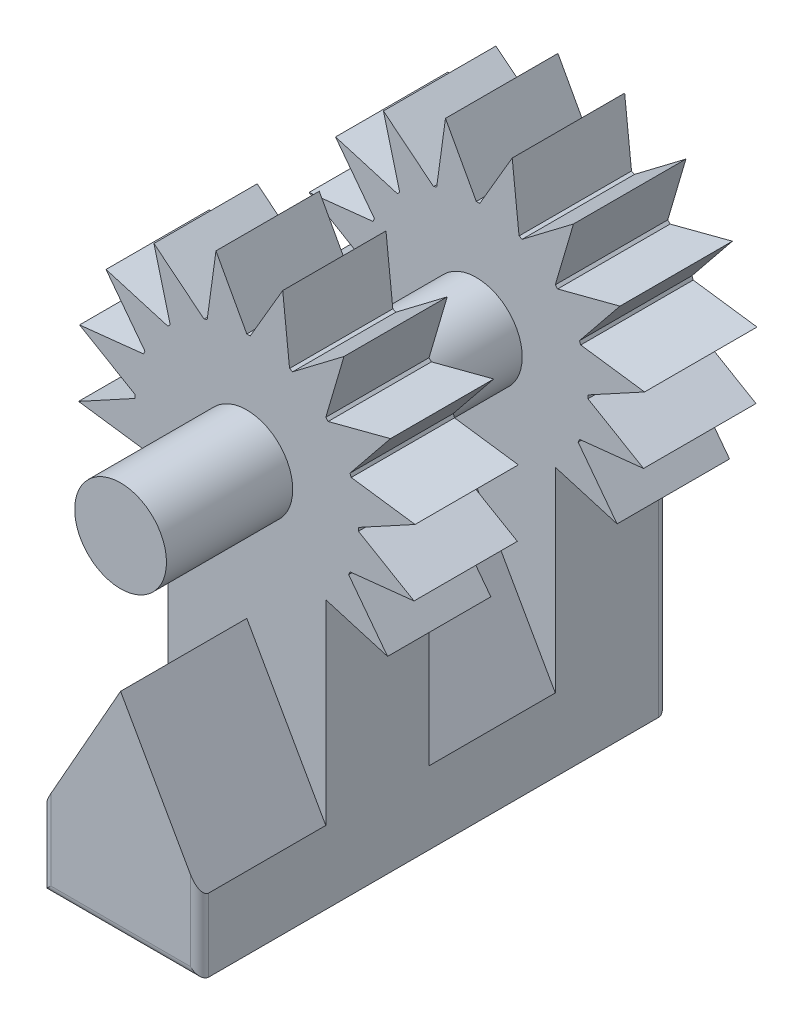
ISO-10303-21;
HEADER;
FILE_DESCRIPTION(('STEP AP214'),'2;1');
FILE_NAME('part.step','',(''),(''),'','','');
FILE_SCHEMA(('AUTOMOTIVE_DESIGN { 1 0 10303 214 1 1 1 1 }'));
ENDSEC;
DATA;
#1=APPLICATION_CONTEXT('core data for automotive mechanical design processes');
#2=APPLICATION_PROTOCOL_DEFINITION('international standard','automotive_design',2000,#1);
#3=PRODUCT_CONTEXT('',#1,'mechanical');
#4=PRODUCT('Part','Part','',(#3));
#5=PRODUCT_RELATED_PRODUCT_CATEGORY('part','',(#4));
#6=PRODUCT_DEFINITION_FORMATION('','',#4);
#7=PRODUCT_DEFINITION_CONTEXT('part definition',#1,'design');
#8=PRODUCT_DEFINITION('design','',#6,#7);
#9=PRODUCT_DEFINITION_SHAPE('','',#8);
#10=(LENGTH_UNIT() NAMED_UNIT(*) SI_UNIT(.MILLI.,.METRE.));
#11=(NAMED_UNIT(*) PLANE_ANGLE_UNIT() SI_UNIT($,.RADIAN.));
#12=(NAMED_UNIT(*) SI_UNIT($,.STERADIAN.) SOLID_ANGLE_UNIT());
#13=UNCERTAINTY_MEASURE_WITH_UNIT(LENGTH_MEASURE(1.E-05),#10,'distance_accuracy_value','');
#14=(GEOMETRIC_REPRESENTATION_CONTEXT(3) GLOBAL_UNCERTAINTY_ASSIGNED_CONTEXT((#13)) GLOBAL_UNIT_ASSIGNED_CONTEXT((#10,
#11,#12)) REPRESENTATION_CONTEXT('',''));
#15=CARTESIAN_POINT('',(0.,0.,0.));
#16=DIRECTION('',(0.,0.,1.));
#17=DIRECTION('',(1.,0.,0.));
#18=AXIS2_PLACEMENT_3D('',#15,#16,#17);
#19=CARTESIAN_POINT('',(0.,6.96546987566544,15.3));
#20=DIRECTION('',(0.,0.,-1.));
#21=DIRECTION('',(-1.,0.,0.));
#22=AXIS2_PLACEMENT_3D('',#19,#20,#21);
#23=CYLINDRICAL_SURFACE('',#22,3.65);
#24=CARTESIAN_POINT('',(0.,6.96546987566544,3.675));
#25=DIRECTION('',(0.,0.,1.));
#26=DIRECTION('',(1.,0.,0.));
#27=AXIS2_PLACEMENT_3D('',#24,#25,#26);
#28=CIRCLE('',#27,3.65);
#29=CARTESIAN_POINT('',(-2.6577144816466,4.46365978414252,3.675));
#30=VERTEX_POINT('',#29);
#31=CARTESIAN_POINT('',(-2.58093975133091,4.38453012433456,3.675));
#32=VERTEX_POINT('',#31);
#33=EDGE_CURVE('E903',#30,#32,#28,.T.);
#34=ORIENTED_EDGE('',*,*,#33,.F.);
#35=DIRECTION('',(0.,0.,1.));
#36=VECTOR('',#35,1.);
#37=CARTESIAN_POINT('',(-2.65771448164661,4.46365978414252,-2.61395129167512));
#38=LINE('',#37,#36);
#39=CARTESIAN_POINT('',(-2.65771448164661,4.46365978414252,0.));
#40=VERTEX_POINT('',#39);
#41=EDGE_CURVE('E1270',#40,#30,#38,.T.);
#42=ORIENTED_EDGE('',*,*,#41,.F.);
#43=CARTESIAN_POINT('',(0.,6.96546987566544,0.));
#44=DIRECTION('',(0.,0.,1.));
#45=DIRECTION('',(-1.,0.,0.));
#46=AXIS2_PLACEMENT_3D('',#43,#44,#45);
#47=CIRCLE('',#46,3.65);
#48=CARTESIAN_POINT('',(-2.28093975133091,4.11594116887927,0.));
#49=VERTEX_POINT('',#48);
#50=EDGE_CURVE('E628',#40,#49,#47,.T.);
#51=ORIENTED_EDGE('',*,*,#50,.T.);
#52=CARTESIAN_POINT('',(-2.28093975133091,4.11594116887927,0.));
#53=CARTESIAN_POINT('',(-2.30067676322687,4.1317293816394,1.96034787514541E-05));
#54=CARTESIAN_POINT('',(-2.32023676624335,4.14773292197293,0.00194800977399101));
#55=CARTESIAN_POINT('',(-2.35877565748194,4.17991828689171,0.00959640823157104));
#56=CARTESIAN_POINT('',(-2.37774714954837,4.19610034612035,0.0153526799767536));
#57=CARTESIAN_POINT('',(-2.41634577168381,4.22968909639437,0.0314014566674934));
#58=CARTESIAN_POINT('',(-2.43584488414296,4.24705394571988,0.0420941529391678));
#59=CARTESIAN_POINT('',(-2.47264785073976,4.28048880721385,0.0681515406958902));
#60=CARTESIAN_POINT('',(-2.4899604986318,4.29656390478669,0.0834966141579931));
#61=CARTESIAN_POINT('',(-2.51498050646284,4.32018358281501,0.11179287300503));
#62=CARTESIAN_POINT('',(-2.52372422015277,4.32853200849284,0.123164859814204));
#63=CARTESIAN_POINT('',(-2.5397815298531,4.34399452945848,0.147637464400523));
#64=CARTESIAN_POINT('',(-2.5470970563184,4.35111028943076,0.160735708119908));
#65=CARTESIAN_POINT('',(-2.55870543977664,4.36247540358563,0.185974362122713));
#66=CARTESIAN_POINT('',(-2.56330722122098,4.36701158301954,0.197842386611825));
#67=CARTESIAN_POINT('',(-2.57103551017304,4.37465801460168,0.222474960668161));
#68=CARTESIAN_POINT('',(-2.57416526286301,4.37777140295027,0.235237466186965));
#69=CARTESIAN_POINT('',(-2.57792676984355,4.3815197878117,0.256730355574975));
#70=CARTESIAN_POINT('',(-2.57905033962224,4.38264171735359,0.265293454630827));
#71=CARTESIAN_POINT('',(-2.5805595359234,4.38414990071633,0.282568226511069));
#72=CARTESIAN_POINT('',(-2.5809434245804,4.3845344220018,0.29128020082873));
#73=CARTESIAN_POINT('',(-2.58093975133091,4.38453012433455,0.3));
#74=B_SPLINE_CURVE_WITH_KNOTS('',3,(#52,#53,#54,#55,#56,#57,#58,#59,#60,#61,#62,#63,#64,#65,#66,
#67,#68,#69,#70,#71,#72,#73),.UNSPECIFIED.,.F.,.F.,(4,2,2,2,2,2,2,2,2,2,4),(0.,
0.0757489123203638,0.152226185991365,0.236444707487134,0.320312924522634,0.369950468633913,
0.419520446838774,0.459903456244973,0.500197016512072,0.526264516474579,0.552393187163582),.UNSPECIFIED.);
#75=CARTESIAN_POINT('',(-2.58093975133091,4.38453012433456,0.3));
#76=VERTEX_POINT('',#75);
#77=EDGE_CURVE('E11',#49,#76,#74,.T.);
#78=ORIENTED_EDGE('',*,*,#77,.T.);
#79=DIRECTION('',(0.,0.,-1.));
#80=VECTOR('',#79,1.);
#81=CARTESIAN_POINT('',(-2.58093975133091,4.38453012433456,15.3));
#82=LINE('',#81,#80);
#83=EDGE_CURVE('E637',#32,#76,#82,.T.);
#84=ORIENTED_EDGE('',*,*,#83,.F.);
#85=EDGE_LOOP('',(#34,#42,#51,#78,#84));
#86=FACE_BOUND('',#85,.T.);
#87=ADVANCED_FACE('F44',(#86),#23,.T.);
#88=CARTESIAN_POINT('',(0.,6.96546987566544,3.675));
#89=DIRECTION('',(0.,0.,1.));
#90=DIRECTION('',(1.,0.,0.));
#91=AXIS2_PLACEMENT_3D('',#88,#89,#90);
#92=CIRCLE('',#91,3.65);
#93=CARTESIAN_POINT('',(-3.41280928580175,5.67116203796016,3.675));
#94=VERTEX_POINT('',#93);
#95=CARTESIAN_POINT('',(-3.37216029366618,5.56867534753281,3.675));
#96=VERTEX_POINT('',#95);
#97=EDGE_CURVE('E894',#94,#96,#92,.T.);
#98=ORIENTED_EDGE('',*,*,#97,.F.);
#99=DIRECTION('',(0.,0.,1.));
#100=VECTOR('',#99,1.);
#101=CARTESIAN_POINT('',(-3.41280928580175,5.67116203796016,-2.45477924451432));
#102=LINE('',#101,#100);
#103=CARTESIAN_POINT('',(-3.41280928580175,5.67116203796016,0.));
#104=VERTEX_POINT('',#103);
#105=EDGE_CURVE('E1293',#104,#94,#102,.T.);
#106=ORIENTED_EDGE('',*,*,#105,.F.);
#107=CARTESIAN_POINT('',(-3.37216029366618,5.56867534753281,0.));
#108=VERTEX_POINT('',#107);
#109=EDGE_CURVE('E784',#104,#108,#47,.T.);
#110=ORIENTED_EDGE('',*,*,#109,.T.);
#111=DIRECTION('',(0.,0.,1.));
#112=VECTOR('',#111,1.);
#113=CARTESIAN_POINT('',(-3.37216029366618,5.56867534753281,-2.61395129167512));
#114=LINE('',#113,#112);
#115=EDGE_CURVE('E1265',#108,#96,#114,.T.);
#116=ORIENTED_EDGE('',*,*,#115,.T.);
#117=EDGE_LOOP('',(#98,#106,#110,#116));
#118=FACE_BOUND('',#117,.T.);
#119=ADVANCED_FACE('F718',(#118),#23,.T.);
#120=CARTESIAN_POINT('',(0.,6.96546987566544,3.675));
#121=DIRECTION('',(0.,0.,1.));
#122=DIRECTION('',(1.,0.,0.));
#123=AXIS2_PLACEMENT_3D('',#120,#121,#122);
#124=CIRCLE('',#123,3.65);
#125=CARTESIAN_POINT('',(-3.6483348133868,7.07571092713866,3.675));
#126=VERTEX_POINT('',#125);
#127=CARTESIAN_POINT('',(-3.65,6.96546987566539,3.675));
#128=VERTEX_POINT('',#127);
#129=EDGE_CURVE('E885',#126,#128,#124,.T.);
#130=ORIENTED_EDGE('',*,*,#129,.F.);
#131=DIRECTION('',(0.,0.,1.));
#132=VECTOR('',#131,1.);
#133=CARTESIAN_POINT('',(-3.6483348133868,7.07571092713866,-2.45726151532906));
#134=LINE('',#133,#132);
#135=CARTESIAN_POINT('',(-3.6483348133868,7.07571092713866,0.));
#136=VERTEX_POINT('',#135);
#137=EDGE_CURVE('E1316',#136,#126,#134,.T.);
#138=ORIENTED_EDGE('',*,*,#137,.F.);
#139=CARTESIAN_POINT('',(-3.65,6.96546987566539,0.));
#140=VERTEX_POINT('',#139);
#141=EDGE_CURVE('E1538',#136,#140,#47,.T.);
#142=ORIENTED_EDGE('',*,*,#141,.T.);
#143=DIRECTION('',(0.,0.,1.));
#144=VECTOR('',#143,1.);
#145=CARTESIAN_POINT('',(-3.65,6.96546987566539,-2.45477924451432));
#146=LINE('',#145,#144);
#147=EDGE_CURVE('E1288',#140,#128,#146,.T.);
#148=ORIENTED_EDGE('',*,*,#147,.T.);
#149=EDGE_LOOP('',(#130,#138,#142,#148));
#150=FACE_BOUND('',#149,.T.);
#151=ADVANCED_FACE('F723',(#150),#23,.T.);
#152=CARTESIAN_POINT('',(0.,6.96546987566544,3.675));
#153=DIRECTION('',(0.,0.,1.));
#154=DIRECTION('',(1.,0.,0.));
#155=AXIS2_PLACEMENT_3D('',#152,#153,#154);
#156=CIRCLE('',#155,3.65);
#157=CARTESIAN_POINT('',(-3.32843443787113,8.463476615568,3.675));
#158=VERTEX_POINT('',#157);
#159=CARTESIAN_POINT('',(-3.37216029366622,8.36226440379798,3.675));
#160=VERTEX_POINT('',#159);
#161=EDGE_CURVE('E876',#158,#160,#156,.T.);
#162=ORIENTED_EDGE('',*,*,#161,.F.);
#163=DIRECTION('',(0.,0.,1.));
#164=VECTOR('',#163,1.);
#165=CARTESIAN_POINT('',(-3.32843443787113,8.463476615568,-2.62556228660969));
#166=LINE('',#165,#164);
#167=CARTESIAN_POINT('',(-3.32843443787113,8.463476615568,0.));
#168=VERTEX_POINT('',#167);
#169=EDGE_CURVE('E1339',#168,#158,#166,.T.);
#170=ORIENTED_EDGE('',*,*,#169,.F.);
#171=CARTESIAN_POINT('',(-3.37216029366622,8.36226440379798,0.));
#172=VERTEX_POINT('',#171);
#173=EDGE_CURVE('E1539',#168,#172,#47,.T.);
#174=ORIENTED_EDGE('',*,*,#173,.T.);
#175=DIRECTION('',(0.,0.,1.));
#176=VECTOR('',#175,1.);
#177=CARTESIAN_POINT('',(-3.37216029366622,8.36226440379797,-2.45726151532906));
#178=LINE('',#177,#176);
#179=EDGE_CURVE('E1311',#172,#160,#178,.T.);
#180=ORIENTED_EDGE('',*,*,#179,.T.);
#181=EDGE_LOOP('',(#162,#170,#174,#180));
#182=FACE_BOUND('',#181,.T.);
#183=ADVANCED_FACE('F1801',(#182),#23,.T.);
#184=CARTESIAN_POINT('',(0.,6.96546987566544,3.675));
#185=DIRECTION('',(0.,0.,1.));
#186=DIRECTION('',(1.,0.,0.));
#187=AXIS2_PLACEMENT_3D('',#184,#185,#186);
#188=CIRCLE('',#187,3.65);
#189=CARTESIAN_POINT('',(-2.50181009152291,9.62318435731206,3.675));
#190=VERTEX_POINT('',#189);
#191=CARTESIAN_POINT('',(-2.58093975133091,9.54640962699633,3.675));
#192=VERTEX_POINT('',#191);
#193=EDGE_CURVE('E867',#190,#192,#188,.T.);
#194=ORIENTED_EDGE('',*,*,#193,.F.);
#195=DIRECTION('',(0.,0.,1.));
#196=VECTOR('',#195,1.);
#197=CARTESIAN_POINT('',(-2.50181009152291,9.62318435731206,-2.61395129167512));
#198=LINE('',#197,#196);
#199=CARTESIAN_POINT('',(-2.50181009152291,9.62318435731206,0.));
#200=VERTEX_POINT('',#199);
#201=EDGE_CURVE('E1362',#200,#190,#198,.T.);
#202=ORIENTED_EDGE('',*,*,#201,.F.);
#203=CARTESIAN_POINT('',(-2.58093975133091,9.54640962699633,0.));
#204=VERTEX_POINT('',#203);
#205=EDGE_CURVE('E1544',#200,#204,#47,.T.);
#206=ORIENTED_EDGE('',*,*,#205,.T.);
#207=DIRECTION('',(0.,0.,1.));
#208=VECTOR('',#207,1.);
#209=CARTESIAN_POINT('',(-2.58093975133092,9.54640962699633,-2.62556228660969));
#210=LINE('',#209,#208);
#211=EDGE_CURVE('E1334',#204,#192,#210,.T.);
#212=ORIENTED_EDGE('',*,*,#211,.T.);
#213=EDGE_LOOP('',(#194,#202,#206,#212));
#214=FACE_BOUND('',#213,.T.);
#215=ADVANCED_FACE('F1812',(#214),#23,.T.);
#216=CARTESIAN_POINT('',(0.,6.96546987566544,3.675));
#217=DIRECTION('',(0.,0.,1.));
#218=DIRECTION('',(1.,0.,0.));
#219=AXIS2_PLACEMENT_3D('',#216,#217,#218);
#220=CIRCLE('',#219,3.65);
#221=CARTESIAN_POINT('',(-1.29430783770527,10.3782791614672,3.675));
#222=VERTEX_POINT('',#221);
#223=CARTESIAN_POINT('',(-1.39679452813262,10.3376301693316,3.675));
#224=VERTEX_POINT('',#223);
#225=EDGE_CURVE('E859',#222,#224,#220,.T.);
#226=ORIENTED_EDGE('',*,*,#225,.F.);
#227=DIRECTION('',(0.,0.,1.));
#228=VECTOR('',#227,1.);
#229=CARTESIAN_POINT('',(-1.29430783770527,10.3782791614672,-2.45477924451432));
#230=LINE('',#229,#228);
#231=CARTESIAN_POINT('',(-1.29430783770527,10.3782791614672,0.));
#232=VERTEX_POINT('',#231);
#233=EDGE_CURVE('E1385',#232,#222,#230,.T.);
#234=ORIENTED_EDGE('',*,*,#233,.F.);
#235=CARTESIAN_POINT('',(-1.39679452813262,10.3376301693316,0.));
#236=VERTEX_POINT('',#235);
#237=EDGE_CURVE('E1815',#232,#236,#47,.T.);
#238=ORIENTED_EDGE('',*,*,#237,.T.);
#239=DIRECTION('',(0.,0.,1.));
#240=VECTOR('',#239,1.);
#241=CARTESIAN_POINT('',(-1.39679452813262,10.3376301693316,-2.61395129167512));
#242=LINE('',#241,#240);
#243=EDGE_CURVE('E1357',#236,#224,#242,.T.);
#244=ORIENTED_EDGE('',*,*,#243,.T.);
#245=EDGE_LOOP('',(#226,#234,#238,#244));
#246=FACE_BOUND('',#245,.T.);
#247=ADVANCED_FACE('F1847',(#246),#23,.T.);
#248=CARTESIAN_POINT('',(0.,6.96546987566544,3.675));
#249=DIRECTION('',(0.,0.,1.));
#250=DIRECTION('',(1.,0.,0.));
#251=AXIS2_PLACEMENT_3D('',#248,#249,#250);
#252=CIRCLE('',#251,3.65);
#253=CARTESIAN_POINT('',(0.110241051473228,10.6138046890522,3.675));
#254=VERTEX_POINT('',#253);
#255=CARTESIAN_POINT('',(0.,10.6154698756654,3.675));
#256=VERTEX_POINT('',#255);
#257=EDGE_CURVE('E850',#254,#256,#252,.T.);
#258=ORIENTED_EDGE('',*,*,#257,.F.);
#259=DIRECTION('',(0.,0.,1.));
#260=VECTOR('',#259,1.);
#261=CARTESIAN_POINT('',(0.110241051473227,10.6138046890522,-2.45726151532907));
#262=LINE('',#261,#260);
#263=CARTESIAN_POINT('',(0.110241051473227,10.6138046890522,0.));
#264=VERTEX_POINT('',#263);
#265=EDGE_CURVE('E1406',#264,#254,#262,.T.);
#266=ORIENTED_EDGE('',*,*,#265,.F.);
#267=CARTESIAN_POINT('',(0.,10.6154698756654,0.));
#268=VERTEX_POINT('',#267);
#269=EDGE_CURVE('E1818',#264,#268,#47,.T.);
#270=ORIENTED_EDGE('',*,*,#269,.T.);
#271=DIRECTION('',(0.,0.,1.));
#272=VECTOR('',#271,1.);
#273=CARTESIAN_POINT('',(0.,10.6154698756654,-2.45477924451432));
#274=LINE('',#273,#272);
#275=EDGE_CURVE('E1380',#268,#256,#274,.T.);
#276=ORIENTED_EDGE('',*,*,#275,.T.);
#277=EDGE_LOOP('',(#258,#266,#270,#276));
#278=FACE_BOUND('',#277,.T.);
#279=ADVANCED_FACE('F1838',(#278),#23,.T.);
#280=CARTESIAN_POINT('',(0.,6.96546987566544,3.675));
#281=DIRECTION('',(0.,0.,1.));
#282=DIRECTION('',(1.,0.,0.));
#283=AXIS2_PLACEMENT_3D('',#280,#281,#282);
#284=CIRCLE('',#283,3.65);
#285=CARTESIAN_POINT('',(1.49800673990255,10.2939043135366,3.675));
#286=VERTEX_POINT('',#285);
#287=CARTESIAN_POINT('',(1.39679452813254,10.3376301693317,3.675));
#288=VERTEX_POINT('',#287);
#289=EDGE_CURVE('E841',#286,#288,#284,.T.);
#290=ORIENTED_EDGE('',*,*,#289,.F.);
#291=DIRECTION('',(0.,0.,1.));
#292=VECTOR('',#291,1.);
#293=CARTESIAN_POINT('',(1.49800673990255,10.2939043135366,-2.62556228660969));
#294=LINE('',#293,#292);
#295=CARTESIAN_POINT('',(1.49800673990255,10.2939043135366,0.));
#296=VERTEX_POINT('',#295);
#297=EDGE_CURVE('E1429',#296,#286,#294,.T.);
#298=ORIENTED_EDGE('',*,*,#297,.F.);
#299=CARTESIAN_POINT('',(1.39679452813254,10.3376301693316,0.));
#300=VERTEX_POINT('',#299);
#301=EDGE_CURVE('E1606',#296,#300,#47,.T.);
#302=ORIENTED_EDGE('',*,*,#301,.T.);
#303=DIRECTION('',(0.,0.,1.));
#304=VECTOR('',#303,1.);
#305=CARTESIAN_POINT('',(1.39679452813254,10.3376301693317,-2.45726151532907));
#306=LINE('',#305,#304);
#307=EDGE_CURVE('E1402',#300,#288,#306,.T.);
#308=ORIENTED_EDGE('',*,*,#307,.T.);
#309=EDGE_LOOP('',(#290,#298,#302,#308));
#310=FACE_BOUND('',#309,.T.);
#311=ADVANCED_FACE('F1830',(#310),#23,.T.);
#312=CARTESIAN_POINT('',(0.,6.96546987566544,3.675));
#313=DIRECTION('',(0.,0.,1.));
#314=DIRECTION('',(1.,0.,0.));
#315=AXIS2_PLACEMENT_3D('',#312,#313,#314);
#316=CIRCLE('',#315,3.65);
#317=CARTESIAN_POINT('',(2.65771448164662,9.46727996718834,3.675));
#318=VERTEX_POINT('',#317);
#319=CARTESIAN_POINT('',(2.58093975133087,9.54640962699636,3.675));
#320=VERTEX_POINT('',#319);
#321=EDGE_CURVE('E832',#318,#320,#316,.T.);
#322=ORIENTED_EDGE('',*,*,#321,.F.);
#323=DIRECTION('',(0.,0.,1.));
#324=VECTOR('',#323,1.);
#325=CARTESIAN_POINT('',(2.65771448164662,9.46727996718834,-2.61395129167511));
#326=LINE('',#325,#324);
#327=CARTESIAN_POINT('',(2.65771448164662,9.46727996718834,0.));
#328=VERTEX_POINT('',#327);
#329=EDGE_CURVE('E1452',#328,#318,#326,.T.);
#330=ORIENTED_EDGE('',*,*,#329,.F.);
#331=CARTESIAN_POINT('',(2.58093975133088,9.54640962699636,0.));
#332=VERTEX_POINT('',#331);
#333=EDGE_CURVE('E1605',#328,#332,#47,.T.);
#334=ORIENTED_EDGE('',*,*,#333,.T.);
#335=DIRECTION('',(0.,0.,1.));
#336=VECTOR('',#335,1.);
#337=CARTESIAN_POINT('',(2.58093975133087,9.54640962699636,-2.62556228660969));
#338=LINE('',#337,#336);
#339=EDGE_CURVE('E1424',#332,#320,#338,.T.);
#340=ORIENTED_EDGE('',*,*,#339,.T.);
#341=EDGE_LOOP('',(#322,#330,#334,#340));
#342=FACE_BOUND('',#341,.T.);
#343=ADVANCED_FACE('F1884',(#342),#23,.T.);
#344=CARTESIAN_POINT('',(0.,6.96546987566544,3.675));
#345=DIRECTION('',(0.,0.,1.));
#346=DIRECTION('',(1.,0.,0.));
#347=AXIS2_PLACEMENT_3D('',#344,#345,#346);
#348=CIRCLE('',#347,3.65);
#349=CARTESIAN_POINT('',(3.41280928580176,8.2597777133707,3.675));
#350=VERTEX_POINT('',#349);
#351=CARTESIAN_POINT('',(3.37216029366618,8.36226440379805,3.675));
#352=VERTEX_POINT('',#351);
#353=EDGE_CURVE('E823',#350,#352,#348,.T.);
#354=ORIENTED_EDGE('',*,*,#353,.F.);
#355=DIRECTION('',(0.,0.,1.));
#356=VECTOR('',#355,1.);
#357=CARTESIAN_POINT('',(3.41280928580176,8.2597777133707,-2.45477924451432));
#358=LINE('',#357,#356);
#359=CARTESIAN_POINT('',(3.41280928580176,8.2597777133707,0.));
#360=VERTEX_POINT('',#359);
#361=EDGE_CURVE('E1473',#360,#350,#358,.T.);
#362=ORIENTED_EDGE('',*,*,#361,.F.);
#363=CARTESIAN_POINT('',(3.37216029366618,8.36226440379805,0.));
#364=VERTEX_POINT('',#363);
#365=EDGE_CURVE('E1534',#360,#364,#47,.T.);
#366=ORIENTED_EDGE('',*,*,#365,.T.);
#367=DIRECTION('',(0.,0.,1.));
#368=VECTOR('',#367,1.);
#369=CARTESIAN_POINT('',(3.37216029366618,8.36226440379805,-2.61395129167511));
#370=LINE('',#369,#368);
#371=EDGE_CURVE('E1447',#364,#352,#370,.T.);
#372=ORIENTED_EDGE('',*,*,#371,.T.);
#373=EDGE_LOOP('',(#354,#362,#366,#372));
#374=FACE_BOUND('',#373,.T.);
#375=ADVANCED_FACE('F1893',(#374),#23,.T.);
#376=CARTESIAN_POINT('',(0.,6.96546987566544,3.675));
#377=DIRECTION('',(0.,0.,1.));
#378=DIRECTION('',(1.,0.,0.));
#379=AXIS2_PLACEMENT_3D('',#376,#377,#378);
#380=CIRCLE('',#379,3.65);
#381=CARTESIAN_POINT('',(3.64833481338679,6.8552288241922,3.675));
#382=VERTEX_POINT('',#381);
#383=CARTESIAN_POINT('',(3.65,6.96546987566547,3.675));
#384=VERTEX_POINT('',#383);
#385=EDGE_CURVE('E814',#382,#384,#380,.T.);
#386=ORIENTED_EDGE('',*,*,#385,.F.);
#387=DIRECTION('',(0.,0.,1.));
#388=VECTOR('',#387,1.);
#389=CARTESIAN_POINT('',(3.6483348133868,6.8552288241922,-2.45726151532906));
#390=LINE('',#389,#388);
#391=CARTESIAN_POINT('',(3.6483348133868,6.8552288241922,0.));
#392=VERTEX_POINT('',#391);
#393=EDGE_CURVE('E1492',#392,#382,#390,.T.);
#394=ORIENTED_EDGE('',*,*,#393,.F.);
#395=CARTESIAN_POINT('',(3.65,6.96546987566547,0.));
#396=VERTEX_POINT('',#395);
#397=EDGE_CURVE('E626',#392,#396,#47,.T.);
#398=ORIENTED_EDGE('',*,*,#397,.T.);
#399=DIRECTION('',(0.,0.,1.));
#400=VECTOR('',#399,1.);
#401=CARTESIAN_POINT('',(3.65,6.96546987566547,-2.45477924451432));
#402=LINE('',#401,#400);
#403=EDGE_CURVE('E1468',#396,#384,#402,.T.);
#404=ORIENTED_EDGE('',*,*,#403,.T.);
#405=EDGE_LOOP('',(#386,#394,#398,#404));
#406=FACE_BOUND('',#405,.T.);
#407=ADVANCED_FACE('F2452',(#406),#23,.T.);
#408=CARTESIAN_POINT('',(0.,6.96546987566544,3.675));
#409=DIRECTION('',(0.,0.,1.));
#410=DIRECTION('',(1.,0.,0.));
#411=AXIS2_PLACEMENT_3D('',#408,#409,#410);
#412=CIRCLE('',#411,3.65);
#413=CARTESIAN_POINT('',(3.32843443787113,5.46746313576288,3.675));
#414=VERTEX_POINT('',#413);
#415=CARTESIAN_POINT('',(3.37216029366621,5.56867534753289,3.675));
#416=VERTEX_POINT('',#415);
#417=EDGE_CURVE('E801',#414,#416,#412,.T.);
#418=ORIENTED_EDGE('',*,*,#417,.F.);
#419=DIRECTION('',(0.,0.,1.));
#420=VECTOR('',#419,1.);
#421=CARTESIAN_POINT('',(3.32843443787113,5.46746313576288,-2.62556228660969));
#422=LINE('',#421,#420);
#423=CARTESIAN_POINT('',(3.32843443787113,5.46746313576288,0.));
#424=VERTEX_POINT('',#423);
#425=EDGE_CURVE('E766',#424,#414,#422,.T.);
#426=ORIENTED_EDGE('',*,*,#425,.F.);
#427=CARTESIAN_POINT('',(3.3721602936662,5.56867534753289,0.));
#428=VERTEX_POINT('',#427);
#429=EDGE_CURVE('E617',#424,#428,#47,.T.);
#430=ORIENTED_EDGE('',*,*,#429,.T.);
#431=DIRECTION('',(0.,0.,1.));
#432=VECTOR('',#431,1.);
#433=CARTESIAN_POINT('',(3.37216029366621,5.56867534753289,-2.45726151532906));
#434=LINE('',#433,#432);
#435=EDGE_CURVE('E1488',#428,#416,#434,.T.);
#436=ORIENTED_EDGE('',*,*,#435,.T.);
#437=EDGE_LOOP('',(#418,#426,#430,#436));
#438=FACE_BOUND('',#437,.T.);
#439=ADVANCED_FACE('F736',(#438),#23,.T.);
#440=CARTESIAN_POINT('',(4.74553628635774,3.5988211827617,-2.62556228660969));
#441=DIRECTION('',(0.79679157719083,0.604254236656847,0.));
#442=DIRECTION('',(-0.604254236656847,0.79679157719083,0.));
#443=AXIS2_PLACEMENT_3D('',#440,#441,#442);
#444=PLANE('',#443);
#445=ORIENTED_EDGE('',*,*,#425,.T.);
#446=DIRECTION('',(-0.604254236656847,0.79679157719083,0.));
#447=VECTOR('',#446,1.);
#448=CARTESIAN_POINT('',(4.74553628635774,3.5988211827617,3.675));
#449=LINE('',#448,#447);
#450=CARTESIAN_POINT('',(4.60065482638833,3.78986713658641,3.675));
#451=VERTEX_POINT('',#450);
#452=EDGE_CURVE('E609',#451,#414,#449,.T.);
#453=ORIENTED_EDGE('',*,*,#452,.F.);
#454=DIRECTION('',(0.,0.,1.));
#455=VECTOR('',#454,1.);
#456=CARTESIAN_POINT('',(4.60065482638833,3.78986713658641,-2.62556228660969));
#457=LINE('',#456,#455);
#458=CARTESIAN_POINT('',(4.60065482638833,3.78986713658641,0.));
#459=VERTEX_POINT('',#458);
#460=EDGE_CURVE('E607',#459,#451,#457,.T.);
#461=ORIENTED_EDGE('',*,*,#460,.F.);
#462=DIRECTION('',(-0.604254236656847,0.79679157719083,0.));
#463=VECTOR('',#462,1.);
#464=CARTESIAN_POINT('',(4.74553628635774,3.5988211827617,0.));
#465=LINE('',#464,#463);
#466=EDGE_CURVE('E767',#459,#424,#465,.T.);
#467=ORIENTED_EDGE('',*,*,#466,.T.);
#468=EDGE_LOOP('',(#445,#453,#461,#467));
#469=FACE_BOUND('',#468,.T.);
#470=ADVANCED_FACE('F751',(#469),#444,.T.);
#471=CARTESIAN_POINT('',(1.39384127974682,4.73404651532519,-2.62556228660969));
#472=DIRECTION('',(-0.282441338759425,-0.959284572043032,0.));
#473=DIRECTION('',(0.959284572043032,-0.282441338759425,0.));
#474=AXIS2_PLACEMENT_3D('',#471,#472,#473);
#475=PLANE('',#474);
#476=ORIENTED_EDGE('',*,*,#460,.T.);
#477=DIRECTION('',(0.959284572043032,-0.282441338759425,0.));
#478=VECTOR('',#477,1.);
#479=CARTESIAN_POINT('',(1.39384127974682,4.73404651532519,3.675));
#480=LINE('',#479,#478);
#481=CARTESIAN_POINT('',(2.58093975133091,4.38453012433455,3.675));
#482=VERTEX_POINT('',#481);
#483=EDGE_CURVE('E587',#482,#451,#480,.T.);
#484=ORIENTED_EDGE('',*,*,#483,.F.);
#485=DIRECTION('',(0.,0.,-1.));
#486=VECTOR('',#485,1.);
#487=CARTESIAN_POINT('',(2.58093975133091,4.38453012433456,15.3));
#488=LINE('',#487,#486);
#489=CARTESIAN_POINT('',(2.58093975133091,4.38453012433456,0.3));
#490=VERTEX_POINT('',#489);
#491=EDGE_CURVE('E603',#482,#490,#488,.T.);
#492=ORIENTED_EDGE('',*,*,#491,.T.);
#493=CARTESIAN_POINT('',(2.28093975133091,4.47285886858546,0.3));
#494=DIRECTION('',(-0.282441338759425,-0.959284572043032,0.));
#495=DIRECTION('',(0.959284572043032,-0.282441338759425,0.));
#496=AXIS2_PLACEMENT_3D('',#493,#494,#495);
#497=ELLIPSE('',#496,0.312733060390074,0.3);
#498=CARTESIAN_POINT('',(2.28093975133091,4.47285886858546,0.));
#499=VERTEX_POINT('',#498);
#500=EDGE_CURVE('E54',#490,#499,#497,.F.);
#501=ORIENTED_EDGE('',*,*,#500,.T.);
#502=DIRECTION('',(0.959284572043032,-0.282441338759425,0.));
#503=VECTOR('',#502,1.);
#504=CARTESIAN_POINT('',(1.39384127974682,4.73404651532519,0.));
#505=LINE('',#504,#503);
#506=EDGE_CURVE('E773',#499,#459,#505,.T.);
#507=ORIENTED_EDGE('',*,*,#506,.T.);
#508=EDGE_LOOP('',(#476,#484,#492,#501,#507));
#509=FACE_BOUND('',#508,.T.);
#510=ADVANCED_FACE('F601',(#509),#475,.T.);
#511=CARTESIAN_POINT('',(5.67266452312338,5.67113016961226,-2.45726151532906));
#512=DIRECTION('',(0.504901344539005,0.863177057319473,0.));
#513=DIRECTION('',(-0.863177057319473,0.504901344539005,0.));
#514=AXIS2_PLACEMENT_3D('',#511,#512,#513);
#515=PLANE('',#514);
#516=ORIENTED_EDGE('',*,*,#393,.T.);
#517=DIRECTION('',(-0.863177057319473,0.504901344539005,0.));
#518=VECTOR('',#517,1.);
#519=CARTESIAN_POINT('',(3.9176938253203,6.69767166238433,3.675));
#520=LINE('',#519,#518);
#521=CARTESIAN_POINT('',(5.46570138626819,5.79218988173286,3.675));
#522=VERTEX_POINT('',#521);
#523=EDGE_CURVE('E811',#522,#382,#520,.T.);
#524=ORIENTED_EDGE('',*,*,#523,.F.);
#525=DIRECTION('',(0.,0.,1.));
#526=VECTOR('',#525,1.);
#527=CARTESIAN_POINT('',(5.46570138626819,5.79218988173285,-2.45726151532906));
#528=LINE('',#527,#526);
#529=CARTESIAN_POINT('',(5.46570138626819,5.79218988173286,0.));
#530=VERTEX_POINT('',#529);
#531=EDGE_CURVE('E776',#530,#522,#528,.T.);
#532=ORIENTED_EDGE('',*,*,#531,.F.);
#533=DIRECTION('',(-0.863177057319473,0.504901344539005,0.));
#534=VECTOR('',#533,1.);
#535=CARTESIAN_POINT('',(5.67266452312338,5.67113016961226,0.));
#536=LINE('',#535,#534);
#537=EDGE_CURVE('E1480',#530,#392,#536,.T.);
#538=ORIENTED_EDGE('',*,*,#537,.T.);
#539=EDGE_LOOP('',(#516,#524,#532,#538));
#540=FACE_BOUND('',#539,.T.);
#541=ADVANCED_FACE('F1763',(#540),#515,.T.);
#542=CARTESIAN_POINT('',(2.14167018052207,5.43730346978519,-2.45726151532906));
#543=DIRECTION('',(0.106160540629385,-0.994349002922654,0.));
#544=DIRECTION('',(0.994349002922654,0.106160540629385,0.));
#545=AXIS2_PLACEMENT_3D('',#542,#543,#544);
#546=PLANE('',#545);
#547=ORIENTED_EDGE('',*,*,#531,.T.);
#548=DIRECTION('',(0.994349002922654,0.106160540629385,0.));
#549=VECTOR('',#548,1.);
#550=CARTESIAN_POINT('',(-0.549828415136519,5.14994868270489,3.675));
#551=LINE('',#550,#549);
#552=EDGE_CURVE('E806',#416,#522,#551,.T.);
#553=ORIENTED_EDGE('',*,*,#552,.F.);
#554=ORIENTED_EDGE('',*,*,#435,.F.);
#555=DIRECTION('',(0.994349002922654,0.106160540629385,0.));
#556=VECTOR('',#555,1.);
#557=CARTESIAN_POINT('',(2.14167018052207,5.43730346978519,0.));
#558=LINE('',#557,#556);
#559=EDGE_CURVE('E1484',#428,#530,#558,.T.);
#560=ORIENTED_EDGE('',*,*,#559,.T.);
#561=EDGE_LOOP('',(#547,#553,#554,#560));
#562=FACE_BOUND('',#561,.T.);
#563=ADVANCED_FACE('F1760',(#562),#546,.T.);
#564=CARTESIAN_POINT('',(5.73618100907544,7.94049064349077,-2.45477924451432));
#565=DIRECTION('',(0.136144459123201,0.990688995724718,0.));
#566=DIRECTION('',(-0.990688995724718,0.136144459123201,0.));
#567=AXIS2_PLACEMENT_3D('',#564,#565,#566);
#568=PLANE('',#567);
#569=ORIENTED_EDGE('',*,*,#361,.T.);
#570=DIRECTION('',(-0.990688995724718,0.136144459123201,0.));
#571=VECTOR('',#570,1.);
#572=CARTESIAN_POINT('',(1.17731002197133,8.56698899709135,3.675));
#573=LINE('',#572,#571);
#574=CARTESIAN_POINT('',(5.49864445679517,7.97313387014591,3.675));
#575=VERTEX_POINT('',#574);
#576=EDGE_CURVE('E820',#575,#350,#573,.T.);
#577=ORIENTED_EDGE('',*,*,#576,.F.);
#578=DIRECTION('',(0.,0.,1.));
#579=VECTOR('',#578,1.);
#580=CARTESIAN_POINT('',(5.49864445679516,7.9731338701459,-2.45477924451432));
#581=LINE('',#580,#579);
#582=CARTESIAN_POINT('',(5.49864445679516,7.9731338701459,0.));
#583=VERTEX_POINT('',#582);
#584=EDGE_CURVE('E1477',#583,#575,#581,.T.);
#585=ORIENTED_EDGE('',*,*,#584,.F.);
#586=DIRECTION('',(-0.990688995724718,0.136144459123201,0.));
#587=VECTOR('',#586,1.);
#588=CARTESIAN_POINT('',(5.73618100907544,7.94049064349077,0.));
#589=LINE('',#588,#587);
#590=EDGE_CURVE('E1459',#583,#360,#589,.T.);
#591=ORIENTED_EDGE('',*,*,#590,.T.);
#592=EDGE_LOOP('',(#569,#577,#585,#591));
#593=FACE_BOUND('',#592,.T.);
#594=ADVANCED_FACE('F1757',(#593),#568,.T.);
#595=CARTESIAN_POINT('',(2.56344921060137,6.37320990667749,-2.45477924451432));
#596=DIRECTION('',(0.478600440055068,-0.878032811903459,0.));
#597=DIRECTION('',(0.878032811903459,0.478600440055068,0.));
#598=AXIS2_PLACEMENT_3D('',#595,#596,#597);
#599=PLANE('',#598);
#600=ORIENTED_EDGE('',*,*,#584,.T.);
#601=DIRECTION('',(0.878032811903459,0.478600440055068,0.));
#602=VECTOR('',#601,1.);
#603=CARTESIAN_POINT('',(-2.09101465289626,3.83614247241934,3.675));
#604=LINE('',#603,#602);
#605=EDGE_CURVE('E817',#384,#575,#604,.T.);
#606=ORIENTED_EDGE('',*,*,#605,.F.);
#607=ORIENTED_EDGE('',*,*,#403,.F.);
#608=DIRECTION('',(0.878032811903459,0.478600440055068,0.));
#609=VECTOR('',#608,1.);
#610=CARTESIAN_POINT('',(2.56344921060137,6.37320990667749,0.));
#611=LINE('',#610,#609);
#612=EDGE_CURVE('E1464',#396,#583,#611,.T.);
#613=ORIENTED_EDGE('',*,*,#612,.T.);
#614=EDGE_LOOP('',(#600,#606,#607,#613));
#615=FACE_BOUND('',#614,.T.);
#616=ADVANCED_FACE('F1754',(#615),#599,.T.);
#617=CARTESIAN_POINT('',(4.9264159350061,10.0614130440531,-2.61395129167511));
#618=DIRECTION('',(-0.253339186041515,0.967377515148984,0.));
#619=DIRECTION('',(-0.967377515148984,-0.253339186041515,0.));
#620=AXIS2_PLACEMENT_3D('',#617,#618,#619);
#621=PLANE('',#620);
#622=ORIENTED_EDGE('',*,*,#329,.T.);
#623=DIRECTION('',(-0.967377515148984,-0.253339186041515,0.));
#624=VECTOR('',#623,1.);
#625=CARTESIAN_POINT('',(-2.14961606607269,8.20832450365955,3.675));
#626=LINE('',#625,#624);
#627=CARTESIAN_POINT('',(4.69446875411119,10.0006701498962,3.675));
#628=VERTEX_POINT('',#627);
#629=EDGE_CURVE('E829',#628,#318,#626,.T.);
#630=ORIENTED_EDGE('',*,*,#629,.F.);
#631=DIRECTION('',(0.,0.,1.));
#632=VECTOR('',#631,1.);
#633=CARTESIAN_POINT('',(4.69446875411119,10.0006701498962,-2.61395129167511));
#634=LINE('',#633,#632);
#635=CARTESIAN_POINT('',(4.69446875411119,10.0006701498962,0.));
#636=VERTEX_POINT('',#635);
#637=EDGE_CURVE('E1455',#636,#628,#634,.T.);
#638=ORIENTED_EDGE('',*,*,#637,.F.);
#639=DIRECTION('',(-0.967377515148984,-0.253339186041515,0.));
#640=VECTOR('',#639,1.);
#641=CARTESIAN_POINT('',(4.9264159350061,10.0614130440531,0.));
#642=LINE('',#641,#640);
#643=EDGE_CURVE('E1437',#636,#328,#642,.T.);
#644=ORIENTED_EDGE('',*,*,#643,.T.);
#645=EDGE_LOOP('',(#622,#630,#638,#644));
#646=FACE_BOUND('',#645,.T.);
#647=ADVANCED_FACE('F1751',(#646),#621,.T.);
#648=CARTESIAN_POINT('',(2.59496633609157,7.39928255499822,-2.61395129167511));
#649=DIRECTION('',(0.77817776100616,-0.628044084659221,0.));
#650=DIRECTION('',(0.628044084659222,0.77817776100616,0.));
#651=AXIS2_PLACEMENT_3D('',#648,#649,#650);
#652=PLANE('',#651);
#653=ORIENTED_EDGE('',*,*,#637,.T.);
#654=DIRECTION('',(0.628044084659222,0.77817776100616,0.));
#655=VECTOR('',#654,1.);
#656=CARTESIAN_POINT('',(-2.04484147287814,1.65033062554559,3.675));
#657=LINE('',#656,#655);
#658=EDGE_CURVE('E826',#352,#628,#657,.T.);
#659=ORIENTED_EDGE('',*,*,#658,.F.);
#660=ORIENTED_EDGE('',*,*,#371,.F.);
#661=DIRECTION('',(0.628044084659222,0.77817776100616,0.));
#662=VECTOR('',#661,1.);
#663=CARTESIAN_POINT('',(2.59496633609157,7.39928255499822,0.));
#664=LINE('',#663,#662);
#665=EDGE_CURVE('E1442',#364,#636,#664,.T.);
#666=ORIENTED_EDGE('',*,*,#665,.T.);
#667=EDGE_LOOP('',(#653,#659,#660,#666));
#668=FACE_BOUND('',#667,.T.);
#669=ADVANCED_FACE('F1747',(#668),#652,.T.);
#670=CARTESIAN_POINT('',(3.36664869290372,11.7110061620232,-2.62556228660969));
#671=DIRECTION('',(-0.60425423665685,0.796791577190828,0.));
#672=DIRECTION('',(-0.796791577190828,-0.60425423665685,0.));
#673=AXIS2_PLACEMENT_3D('',#670,#671,#672);
#674=PLANE('',#673);
#675=ORIENTED_EDGE('',*,*,#297,.T.);
#676=DIRECTION('',(-0.796791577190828,-0.60425423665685,0.));
#677=VECTOR('',#676,1.);
#678=CARTESIAN_POINT('',(-4.40919442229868,5.81412386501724,3.675));
#679=LINE('',#678,#677);
#680=CARTESIAN_POINT('',(3.17560273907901,11.5661247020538,3.675));
#681=VERTEX_POINT('',#680);
#682=EDGE_CURVE('E838',#681,#286,#679,.T.);
#683=ORIENTED_EDGE('',*,*,#682,.F.);
#684=DIRECTION('',(0.,0.,1.));
#685=VECTOR('',#684,1.);
#686=CARTESIAN_POINT('',(3.17560273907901,11.5661247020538,-2.62556228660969));
#687=LINE('',#686,#685);
#688=CARTESIAN_POINT('',(3.17560273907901,11.5661247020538,0.));
#689=VERTEX_POINT('',#688);
#690=EDGE_CURVE('E1433',#689,#681,#687,.T.);
#691=ORIENTED_EDGE('',*,*,#690,.F.);
#692=DIRECTION('',(-0.796791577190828,-0.60425423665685,0.));
#693=VECTOR('',#692,1.);
#694=CARTESIAN_POINT('',(3.36664869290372,11.7110061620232,0.));
#695=LINE('',#694,#693);
#696=EDGE_CURVE('E1414',#689,#296,#695,.T.);
#697=ORIENTED_EDGE('',*,*,#696,.T.);
#698=EDGE_LOOP('',(#675,#683,#691,#697));
#699=FACE_BOUND('',#698,.T.);
#700=ADVANCED_FACE('F1742',(#699),#674,.T.);
#701=CARTESIAN_POINT('',(2.23142336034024,8.35931115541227,-2.62556228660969));
#702=DIRECTION('',(0.959284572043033,-0.282441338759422,0.));
#703=DIRECTION('',(0.282441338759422,0.959284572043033,0.));
#704=AXIS2_PLACEMENT_3D('',#701,#702,#703);
#705=PLANE('',#704);
#706=ORIENTED_EDGE('',*,*,#690,.T.);
#707=DIRECTION('',(0.282441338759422,0.959284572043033,0.));
#708=VECTOR('',#707,1.);
#709=CARTESIAN_POINT('',(-0.211469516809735,0.062262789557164,3.675));
#710=LINE('',#709,#708);
#711=EDGE_CURVE('E835',#320,#681,#710,.T.);
#712=ORIENTED_EDGE('',*,*,#711,.F.);
#713=ORIENTED_EDGE('',*,*,#339,.F.);
#714=DIRECTION('',(0.282441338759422,0.959284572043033,0.));
#715=VECTOR('',#714,1.);
#716=CARTESIAN_POINT('',(2.23142336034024,8.35931115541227,0.));
#717=LINE('',#716,#715);
#718=EDGE_CURVE('E1419',#332,#689,#717,.T.);
#719=ORIENTED_EDGE('',*,*,#718,.T.);
#720=EDGE_LOOP('',(#706,#712,#713,#719));
#721=FACE_BOUND('',#720,.T.);
#722=ADVANCED_FACE('F1737',(#721),#705,.T.);
#723=CARTESIAN_POINT('',(1.29433970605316,12.6381343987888,-2.45726151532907));
#724=DIRECTION('',(-0.863177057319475,0.504901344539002,0.));
#725=DIRECTION('',(-0.504901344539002,-0.863177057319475,0.));
#726=AXIS2_PLACEMENT_3D('',#723,#724,#725);
#727=PLANE('',#726);
#728=ORIENTED_EDGE('',*,*,#265,.T.);
#729=DIRECTION('',(-0.504901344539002,-0.863177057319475,0.));
#730=VECTOR('',#729,1.);
#731=CARTESIAN_POINT('',(-4.54356266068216,2.6576828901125,3.675));
#732=LINE('',#731,#730);
#733=CARTESIAN_POINT('',(1.17327999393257,12.4311712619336,3.675));
#734=VERTEX_POINT('',#733);
#735=EDGE_CURVE('E847',#734,#254,#732,.T.);
#736=ORIENTED_EDGE('',*,*,#735,.F.);
#737=DIRECTION('',(0.,0.,1.));
#738=VECTOR('',#737,1.);
#739=CARTESIAN_POINT('',(1.17327999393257,12.4311712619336,-2.45726151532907));
#740=LINE('',#739,#738);
#741=CARTESIAN_POINT('',(1.17327999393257,12.4311712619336,0.));
#742=VERTEX_POINT('',#741);
#743=EDGE_CURVE('E1410',#742,#734,#740,.T.);
#744=ORIENTED_EDGE('',*,*,#743,.F.);
#745=DIRECTION('',(-0.504901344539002,-0.863177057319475,0.));
#746=VECTOR('',#745,1.);
#747=CARTESIAN_POINT('',(1.29433970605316,12.6381343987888,0.));
#748=LINE('',#747,#746);
#749=EDGE_CURVE('E1392',#742,#264,#748,.T.);
#750=ORIENTED_EDGE('',*,*,#749,.T.);
#751=EDGE_LOOP('',(#728,#736,#744,#750));
#752=FACE_BOUND('',#751,.T.);
#753=ADVANCED_FACE('F1732',(#752),#727,.T.);
#754=CARTESIAN_POINT('',(1.52816640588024,9.10714005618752,-2.45726151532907));
#755=DIRECTION('',(0.994349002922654,0.106160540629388,0.));
#756=DIRECTION('',(-0.106160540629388,0.994349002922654,0.));
#757=AXIS2_PLACEMENT_3D('',#754,#755,#756);
#758=PLANE('',#757);
#759=ORIENTED_EDGE('',*,*,#743,.T.);
#760=DIRECTION('',(-0.106160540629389,0.994349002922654,0.));
#761=VECTOR('',#760,1.);
#762=CARTESIAN_POINT('',(2.47229929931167,0.263952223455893,3.675));
#763=LINE('',#762,#761);
#764=EDGE_CURVE('E844',#288,#734,#763,.T.);
#765=ORIENTED_EDGE('',*,*,#764,.F.);
#766=ORIENTED_EDGE('',*,*,#307,.F.);
#767=DIRECTION('',(-0.106160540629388,0.994349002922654,0.));
#768=VECTOR('',#767,1.);
#769=CARTESIAN_POINT('',(1.52816640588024,9.10714005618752,0.));
#770=LINE('',#769,#768);
#771=EDGE_CURVE('E1397',#300,#742,#770,.T.);
#772=ORIENTED_EDGE('',*,*,#771,.T.);
#773=EDGE_LOOP('',(#759,#765,#766,#772));
#774=FACE_BOUND('',#773,.T.);
#775=ADVANCED_FACE('F1727',(#774),#758,.T.);
#776=CARTESIAN_POINT('',(-0.97502076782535,12.7016508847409,-2.45477924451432));
#777=DIRECTION('',(-0.990688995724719,0.136144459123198,0.));
#778=DIRECTION('',(-0.136144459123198,-0.990688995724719,0.));
#779=AXIS2_PLACEMENT_3D('',#776,#777,#778);
#780=PLANE('',#779);
#781=ORIENTED_EDGE('',*,*,#233,.T.);
#782=DIRECTION('',(-0.136144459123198,-0.990688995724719,0.));
#783=VECTOR('',#782,1.);
#784=CARTESIAN_POINT('',(-2.67010670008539,0.366936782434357,3.675));
#785=LINE('',#784,#783);
#786=CARTESIAN_POINT('',(-1.00766399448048,12.4641143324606,3.675));
#787=VERTEX_POINT('',#786);
#788=EDGE_CURVE('E856',#787,#222,#785,.T.);
#789=ORIENTED_EDGE('',*,*,#788,.F.);
#790=DIRECTION('',(0.,0.,1.));
#791=VECTOR('',#790,1.);
#792=CARTESIAN_POINT('',(-1.00766399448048,12.4641143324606,-2.45477924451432));
#793=LINE('',#792,#791);
#794=CARTESIAN_POINT('',(-1.00766399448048,12.4641143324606,0.));
#795=VERTEX_POINT('',#794);
#796=EDGE_CURVE('E1389',#795,#787,#793,.T.);
#797=ORIENTED_EDGE('',*,*,#796,.F.);
#798=DIRECTION('',(-0.136144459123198,-0.990688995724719,0.));
#799=VECTOR('',#798,1.);
#800=CARTESIAN_POINT('',(-0.97502076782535,12.7016508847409,0.));
#801=LINE('',#800,#799);
#802=EDGE_CURVE('E1370',#795,#232,#801,.T.);
#803=ORIENTED_EDGE('',*,*,#802,.T.);
#804=EDGE_LOOP('',(#781,#789,#797,#803));
#805=FACE_BOUND('',#804,.T.);
#806=ADVANCED_FACE('F1722',(#805),#780,.T.);
#807=CARTESIAN_POINT('',(0.592259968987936,9.52891908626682,-2.45477924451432));
#808=DIRECTION('',(0.878032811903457,0.478600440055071,0.));
#809=DIRECTION('',(-0.478600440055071,0.878032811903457,0.));
#810=AXIS2_PLACEMENT_3D('',#807,#808,#809);
#811=PLANE('',#810);
#812=ORIENTED_EDGE('',*,*,#796,.T.);
#813=DIRECTION('',(-0.478600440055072,0.878032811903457,0.));
#814=VECTOR('',#813,1.);
#815=CARTESIAN_POINT('',(4.46090589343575,2.43156234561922,3.675));
#816=LINE('',#815,#814);
#817=EDGE_CURVE('E853',#256,#787,#816,.T.);
#818=ORIENTED_EDGE('',*,*,#817,.F.);
#819=ORIENTED_EDGE('',*,*,#275,.F.);
#820=DIRECTION('',(-0.478600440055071,0.878032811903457,0.));
#821=VECTOR('',#820,1.);
#822=CARTESIAN_POINT('',(0.592259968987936,9.52891908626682,0.));
#823=LINE('',#822,#821);
#824=EDGE_CURVE('E1375',#268,#795,#823,.T.);
#825=ORIENTED_EDGE('',*,*,#824,.T.);
#826=EDGE_LOOP('',(#812,#818,#819,#825));
#827=FACE_BOUND('',#826,.T.);
#828=ADVANCED_FACE('F1717',(#827),#811,.T.);
#829=CARTESIAN_POINT('',(-3.09594316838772,11.8918858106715,-2.61395129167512));
#830=DIRECTION('',(-0.967377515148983,-0.253339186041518,0.));
#831=DIRECTION('',(0.253339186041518,-0.967377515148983,0.));
#832=AXIS2_PLACEMENT_3D('',#829,#830,#831);
#833=PLANE('',#832);
#834=ORIENTED_EDGE('',*,*,#201,.T.);
#835=DIRECTION('',(0.253339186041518,-0.967377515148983,0.));
#836=VECTOR('',#835,1.);
#837=CARTESIAN_POINT('',(0.0171563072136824,0.00449293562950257,3.675));
#838=LINE('',#837,#836);
#839=CARTESIAN_POINT('',(-3.03520027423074,11.6599386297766,3.675));
#840=VERTEX_POINT('',#839);
#841=EDGE_CURVE('E864',#840,#190,#838,.T.);
#842=ORIENTED_EDGE('',*,*,#841,.F.);
#843=DIRECTION('',(0.,0.,1.));
#844=VECTOR('',#843,1.);
#845=CARTESIAN_POINT('',(-3.03520027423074,11.6599386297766,-2.61395129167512));
#846=LINE('',#845,#844);
#847=CARTESIAN_POINT('',(-3.03520027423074,11.6599386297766,0.));
#848=VERTEX_POINT('',#847);
#849=EDGE_CURVE('E1366',#848,#840,#846,.T.);
#850=ORIENTED_EDGE('',*,*,#849,.F.);
#851=DIRECTION('',(0.253339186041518,-0.967377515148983,0.));
#852=VECTOR('',#851,1.);
#853=CARTESIAN_POINT('',(-3.09594316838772,11.8918858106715,0.));
#854=LINE('',#853,#852);
#855=EDGE_CURVE('E1347',#848,#200,#854,.T.);
#856=ORIENTED_EDGE('',*,*,#855,.T.);
#857=EDGE_LOOP('',(#834,#842,#850,#856));
#858=FACE_BOUND('',#857,.T.);
#859=ADVANCED_FACE('F1712',(#858),#833,.T.);
#860=CARTESIAN_POINT('',(-0.433812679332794,9.56043621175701,-2.61395129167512));
#861=DIRECTION('',(0.628044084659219,0.778177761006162,0.));
#862=DIRECTION('',(-0.778177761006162,0.628044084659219,0.));
#863=AXIS2_PLACEMENT_3D('',#860,#861,#862);
#864=PLANE('',#863);
#865=ORIENTED_EDGE('',*,*,#849,.T.);
#866=DIRECTION('',(-0.778177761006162,0.628044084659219,0.));
#867=VECTOR('',#866,1.);
#868=CARTESIAN_POINT('',(4.50135861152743,5.57740650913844,3.675));
#869=LINE('',#868,#867);
#870=EDGE_CURVE('E861',#224,#840,#869,.T.);
#871=ORIENTED_EDGE('',*,*,#870,.F.);
#872=ORIENTED_EDGE('',*,*,#243,.F.);
#873=DIRECTION('',(-0.778177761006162,0.628044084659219,0.));
#874=VECTOR('',#873,1.);
#875=CARTESIAN_POINT('',(-0.433812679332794,9.56043621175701,0.));
#876=LINE('',#875,#874);
#877=EDGE_CURVE('E1352',#236,#848,#876,.T.);
#878=ORIENTED_EDGE('',*,*,#877,.T.);
#879=EDGE_LOOP('',(#865,#871,#872,#878));
#880=FACE_BOUND('',#879,.T.);
#881=ADVANCED_FACE('F1707',(#880),#864,.T.);
#882=CARTESIAN_POINT('',(-4.74553628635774,10.3321185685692,-2.62556228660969));
#883=DIRECTION('',(-0.79679157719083,-0.604254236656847,0.));
#884=DIRECTION('',(0.604254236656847,-0.79679157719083,0.));
#885=AXIS2_PLACEMENT_3D('',#882,#883,#884);
#886=PLANE('',#885);
#887=ORIENTED_EDGE('',*,*,#169,.T.);
#888=DIRECTION('',(0.604254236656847,-0.79679157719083,0.));
#889=VECTOR('',#888,1.);
#890=CARTESIAN_POINT('',(1.96171925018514,1.48768787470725,3.675));
#891=LINE('',#890,#889);
#892=CARTESIAN_POINT('',(-4.60065482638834,10.1410726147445,3.675));
#893=VERTEX_POINT('',#892);
#894=EDGE_CURVE('E873',#893,#158,#891,.T.);
#895=ORIENTED_EDGE('',*,*,#894,.F.);
#896=DIRECTION('',(0.,0.,1.));
#897=VECTOR('',#896,1.);
#898=CARTESIAN_POINT('',(-4.60065482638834,10.1410726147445,-2.62556228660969));
#899=LINE('',#898,#897);
#900=CARTESIAN_POINT('',(-4.60065482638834,10.1410726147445,0.));
#901=VERTEX_POINT('',#900);
#902=EDGE_CURVE('E1343',#901,#893,#899,.T.);
#903=ORIENTED_EDGE('',*,*,#902,.F.);
#904=DIRECTION('',(0.604254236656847,-0.79679157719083,0.));
#905=VECTOR('',#904,1.);
#906=CARTESIAN_POINT('',(-4.74553628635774,10.3321185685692,0.));
#907=LINE('',#906,#905);
#908=EDGE_CURVE('E1324',#901,#168,#907,.T.);
#909=ORIENTED_EDGE('',*,*,#908,.T.);
#910=EDGE_LOOP('',(#887,#895,#903,#909));
#911=FACE_BOUND('',#910,.T.);
#912=ADVANCED_FACE('F1702',(#911),#886,.T.);
#913=CARTESIAN_POINT('',(-1.39384127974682,9.19689323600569,-2.62556228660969));
#914=DIRECTION('',(0.282441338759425,0.959284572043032,0.));
#915=DIRECTION('',(-0.959284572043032,0.282441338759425,0.));
#916=AXIS2_PLACEMENT_3D('',#913,#914,#915);
#917=PLANE('',#916);
#918=ORIENTED_EDGE('',*,*,#902,.T.);
#919=DIRECTION('',(-0.959284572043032,0.282441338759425,0.));
#920=VECTOR('',#919,1.);
#921=CARTESIAN_POINT('',(2.38063008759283,8.08557884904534,3.675));
#922=LINE('',#921,#920);
#923=EDGE_CURVE('E870',#192,#893,#922,.T.);
#924=ORIENTED_EDGE('',*,*,#923,.F.);
#925=ORIENTED_EDGE('',*,*,#211,.F.);
#926=DIRECTION('',(-0.959284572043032,0.282441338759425,0.));
#927=VECTOR('',#926,1.);
#928=CARTESIAN_POINT('',(-1.39384127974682,9.19689323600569,0.));
#929=LINE('',#928,#927);
#930=EDGE_CURVE('E1329',#204,#901,#929,.T.);
#931=ORIENTED_EDGE('',*,*,#930,.T.);
#932=EDGE_LOOP('',(#918,#924,#925,#931));
#933=FACE_BOUND('',#932,.T.);
#934=ADVANCED_FACE('F1697',(#933),#917,.T.);
#935=CARTESIAN_POINT('',(-5.67266452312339,8.25980958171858,-2.45726151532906));
#936=DIRECTION('',(-0.504901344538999,-0.863177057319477,0.));
#937=DIRECTION('',(0.863177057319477,-0.504901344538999,0.));
#938=AXIS2_PLACEMENT_3D('',#935,#936,#937);
#939=PLANE('',#938);
#940=ORIENTED_EDGE('',*,*,#137,.T.);
#941=DIRECTION('',(0.863177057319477,-0.504901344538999,0.));
#942=VECTOR('',#941,1.);
#943=CARTESIAN_POINT('',(2.15367798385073,3.68191815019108,3.675));
#944=LINE('',#943,#942);
#945=CARTESIAN_POINT('',(-5.46570138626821,8.13874986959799,3.675));
#946=VERTEX_POINT('',#945);
#947=EDGE_CURVE('E882',#946,#126,#944,.T.);
#948=ORIENTED_EDGE('',*,*,#947,.F.);
#949=DIRECTION('',(0.,0.,1.));
#950=VECTOR('',#949,1.);
#951=CARTESIAN_POINT('',(-5.46570138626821,8.13874986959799,-2.45726151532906));
#952=LINE('',#951,#950);
#953=CARTESIAN_POINT('',(-5.46570138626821,8.13874986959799,0.));
#954=VERTEX_POINT('',#953);
#955=EDGE_CURVE('E1320',#954,#946,#952,.T.);
#956=ORIENTED_EDGE('',*,*,#955,.F.);
#957=DIRECTION('',(0.863177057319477,-0.504901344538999,0.));
#958=VECTOR('',#957,1.);
#959=CARTESIAN_POINT('',(-5.67266452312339,8.25980958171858,0.));
#960=LINE('',#959,#958);
#961=EDGE_CURVE('E1301',#954,#136,#960,.T.);
#962=ORIENTED_EDGE('',*,*,#961,.T.);
#963=EDGE_LOOP('',(#940,#948,#956,#962));
#964=FACE_BOUND('',#963,.T.);
#965=ADVANCED_FACE('F1692',(#964),#939,.T.);
#966=CARTESIAN_POINT('',(-2.14167018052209,8.49363628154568,-2.45726151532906));
#967=DIRECTION('',(-0.106160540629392,0.994349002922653,0.));
#968=DIRECTION('',(-0.994349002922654,-0.106160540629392,0.));
#969=AXIS2_PLACEMENT_3D('',#966,#967,#968);
#970=PLANE('',#969);
#971=ORIENTED_EDGE('',*,*,#955,.T.);
#972=DIRECTION('',(-0.994349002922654,-0.106160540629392,0.));
#973=VECTOR('',#972,1.);
#974=CARTESIAN_POINT('',(-0.92073032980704,8.62398853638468,3.675));
#975=LINE('',#974,#973);
#976=EDGE_CURVE('E879',#160,#946,#975,.T.);
#977=ORIENTED_EDGE('',*,*,#976,.F.);
#978=ORIENTED_EDGE('',*,*,#179,.F.);
#979=DIRECTION('',(-0.994349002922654,-0.106160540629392,0.));
#980=VECTOR('',#979,1.);
#981=CARTESIAN_POINT('',(-2.14167018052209,8.49363628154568,0.));
#982=LINE('',#981,#980);
#983=EDGE_CURVE('E1306',#172,#954,#982,.T.);
#984=ORIENTED_EDGE('',*,*,#983,.T.);
#985=EDGE_LOOP('',(#971,#977,#978,#984));
#986=FACE_BOUND('',#985,.T.);
#987=ADVANCED_FACE('F1688',(#986),#970,.T.);
#988=CARTESIAN_POINT('',(-5.73618100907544,5.99044910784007,-2.45477924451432));
#989=DIRECTION('',(-0.136144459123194,-0.990688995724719,0.));
#990=DIRECTION('',(0.990688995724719,-0.136144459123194,0.));
#991=AXIS2_PLACEMENT_3D('',#988,#989,#990);
#992=PLANE('',#991);
#993=ORIENTED_EDGE('',*,*,#105,.T.);
#994=DIRECTION('',(0.990688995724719,-0.136144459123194,0.));
#995=VECTOR('',#994,1.);
#996=CARTESIAN_POINT('',(0.701650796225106,5.10573641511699,3.675));
#997=LINE('',#996,#995);
#998=CARTESIAN_POINT('',(-5.49864445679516,5.95780588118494,3.675));
#999=VERTEX_POINT('',#998);
#1000=EDGE_CURVE('E891',#999,#94,#997,.T.);
#1001=ORIENTED_EDGE('',*,*,#1000,.F.);
#1002=DIRECTION('',(0.,0.,1.));
#1003=VECTOR('',#1002,1.);
#1004=CARTESIAN_POINT('',(-5.49864445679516,5.95780588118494,-2.45477924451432));
#1005=LINE('',#1004,#1003);
#1006=CARTESIAN_POINT('',(-5.49864445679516,5.95780588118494,0.));
#1007=VERTEX_POINT('',#1006);
#1008=EDGE_CURVE('E1297',#1007,#999,#1005,.T.);
#1009=ORIENTED_EDGE('',*,*,#1008,.F.);
#1010=DIRECTION('',(0.990688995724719,-0.136144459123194,0.));
#1011=VECTOR('',#1010,1.);
#1012=CARTESIAN_POINT('',(-5.73618100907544,5.99044910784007,0.));
#1013=LINE('',#1012,#1011);
#1014=EDGE_CURVE('E1278',#1007,#104,#1013,.T.);
#1015=ORIENTED_EDGE('',*,*,#1014,.T.);
#1016=EDGE_LOOP('',(#993,#1001,#1009,#1015));
#1017=FACE_BOUND('',#1016,.T.);
#1018=ADVANCED_FACE('F1685',(#1017),#992,.T.);
#1019=CARTESIAN_POINT('',(-2.56344921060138,7.55772984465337,-2.45477924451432));
#1020=DIRECTION('',(-0.478600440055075,0.878032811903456,0.));
#1021=DIRECTION('',(-0.878032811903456,-0.478600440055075,0.));
#1022=AXIS2_PLACEMENT_3D('',#1019,#1020,#1021);
#1023=PLANE('',#1022);
#1024=ORIENTED_EDGE('',*,*,#1008,.T.);
#1025=DIRECTION('',(-0.878032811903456,-0.478600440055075,0.));
#1026=VECTOR('',#1025,1.);
#1027=CARTESIAN_POINT('',(-3.76314083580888,6.90379877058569,3.675));
#1028=LINE('',#1027,#1026);
#1029=EDGE_CURVE('E888',#128,#999,#1028,.T.);
#1030=ORIENTED_EDGE('',*,*,#1029,.F.);
#1031=ORIENTED_EDGE('',*,*,#147,.F.);
#1032=DIRECTION('',(-0.878032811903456,-0.478600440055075,0.));
#1033=VECTOR('',#1032,1.);
#1034=CARTESIAN_POINT('',(-2.56344921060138,7.55772984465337,0.));
#1035=LINE('',#1034,#1033);
#1036=EDGE_CURVE('E1283',#140,#1007,#1035,.T.);
#1037=ORIENTED_EDGE('',*,*,#1036,.T.);
#1038=EDGE_LOOP('',(#1024,#1030,#1031,#1037));
#1039=FACE_BOUND('',#1038,.T.);
#1040=ADVANCED_FACE('F1682',(#1039),#1023,.T.);
#1041=CARTESIAN_POINT('',(-4.92641593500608,3.8695267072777,-2.61395129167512));
#1042=DIRECTION('',(0.253339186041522,-0.967377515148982,0.));
#1043=DIRECTION('',(0.967377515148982,0.253339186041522,0.));
#1044=AXIS2_PLACEMENT_3D('',#1041,#1042,#1043);
#1045=PLANE('',#1044);
#1046=ORIENTED_EDGE('',*,*,#41,.T.);
#1047=DIRECTION('',(0.967377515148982,0.253339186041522,0.));
#1048=VECTOR('',#1047,1.);
#1049=CARTESIAN_POINT('',(-1.2645038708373,4.8285171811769,3.675));
#1050=LINE('',#1049,#1048);
#1051=CARTESIAN_POINT('',(-4.69446875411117,3.93026960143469,3.675));
#1052=VERTEX_POINT('',#1051);
#1053=EDGE_CURVE('E900',#1052,#30,#1050,.T.);
#1054=ORIENTED_EDGE('',*,*,#1053,.F.);
#1055=DIRECTION('',(0.,0.,1.));
#1056=VECTOR('',#1055,1.);
#1057=CARTESIAN_POINT('',(-4.69446875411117,3.93026960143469,-2.61395129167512));
#1058=LINE('',#1057,#1056);
#1059=CARTESIAN_POINT('',(-4.69446875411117,3.93026960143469,0.));
#1060=VERTEX_POINT('',#1059);
#1061=EDGE_CURVE('E1274',#1060,#1052,#1058,.T.);
#1062=ORIENTED_EDGE('',*,*,#1061,.F.);
#1063=DIRECTION('',(0.967377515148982,0.253339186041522,0.));
#1064=VECTOR('',#1063,1.);
#1065=CARTESIAN_POINT('',(-4.92641593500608,3.8695267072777,0.));
#1066=LINE('',#1065,#1064);
#1067=EDGE_CURVE('E1248',#1060,#40,#1066,.T.);
#1068=ORIENTED_EDGE('',*,*,#1067,.T.);
#1069=EDGE_LOOP('',(#1046,#1054,#1062,#1068));
#1070=FACE_BOUND('',#1069,.T.);
#1071=ADVANCED_FACE('F1557',(#1070),#1045,.T.);
#1072=CARTESIAN_POINT('',(-2.59496633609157,6.53165719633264,-2.61395129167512));
#1073=DIRECTION('',(-0.778177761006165,0.628044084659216,0.));
#1074=DIRECTION('',(-0.628044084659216,-0.778177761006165,0.));
#1075=AXIS2_PLACEMENT_3D('',#1072,#1073,#1074);
#1076=PLANE('',#1075);
#1077=ORIENTED_EDGE('',*,*,#1061,.T.);
#1078=DIRECTION('',(-0.628044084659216,-0.778177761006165,0.));
#1079=VECTOR('',#1078,1.);
#1080=CARTESIAN_POINT('',(-4.763625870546,3.84458050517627,3.675));
#1081=LINE('',#1080,#1079);
#1082=EDGE_CURVE('E897',#96,#1052,#1081,.T.);
#1083=ORIENTED_EDGE('',*,*,#1082,.F.);
#1084=ORIENTED_EDGE('',*,*,#115,.F.);
#1085=DIRECTION('',(-0.628044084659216,-0.778177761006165,0.));
#1086=VECTOR('',#1085,1.);
#1087=CARTESIAN_POINT('',(-2.59496633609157,6.53165719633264,0.));
#1088=LINE('',#1087,#1086);
#1089=EDGE_CURVE('E1260',#108,#1060,#1088,.T.);
#1090=ORIENTED_EDGE('',*,*,#1089,.T.);
#1091=EDGE_LOOP('',(#1077,#1083,#1084,#1090));
#1092=FACE_BOUND('',#1091,.T.);
#1093=ADVANCED_FACE('F1554',(#1092),#1076,.T.);
#1094=CARTESIAN_POINT('',(-2.58093975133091,4.38453012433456,15.3));
#1095=DIRECTION('',(1.,0.,0.));
#1096=DIRECTION('',(0.,1.,0.));
#1097=AXIS2_PLACEMENT_3D('',#1094,#1095,#1096);
#1098=PLANE('',#1097);
#1099=ORIENTED_EDGE('',*,*,#83,.T.);
#1100=DIRECTION('',(0.,-1.,0.));
#1101=VECTOR('',#1100,1.);
#1102=CARTESIAN_POINT('',(-2.58093975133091,-4.38453012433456,0.3));
#1103=LINE('',#1102,#1101);
#1104=CARTESIAN_POINT('',(-2.58093975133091,-4.38453012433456,0.3));
#1105=VERTEX_POINT('',#1104);
#1106=EDGE_CURVE('E667',#76,#1105,#1103,.T.);
#1107=ORIENTED_EDGE('',*,*,#1106,.T.);
#1108=DIRECTION('',(0.,0.,-1.));
#1109=VECTOR('',#1108,1.);
#1110=CARTESIAN_POINT('',(-2.58093975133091,-4.38453012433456,15.3));
#1111=LINE('',#1110,#1109);
#1112=CARTESIAN_POINT('',(-2.58093975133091,-4.38453012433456,15.));
#1113=VERTEX_POINT('',#1112);
#1114=EDGE_CURVE('E633',#1113,#1105,#1111,.T.);
#1115=ORIENTED_EDGE('',*,*,#1114,.F.);
#1116=DIRECTION('',(0.,-1.,0.));
#1117=VECTOR('',#1116,1.);
#1118=CARTESIAN_POINT('',(-2.58093975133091,4.38453012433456,15.));
#1119=LINE('',#1118,#1117);
#1120=CARTESIAN_POINT('',(-2.58093975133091,-2.00387390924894,15.));
#1121=VERTEX_POINT('',#1120);
#1122=EDGE_CURVE('E664',#1113,#1121,#1119,.F.);
#1123=ORIENTED_EDGE('',*,*,#1122,.T.);
#1124=DIRECTION('',(0.,0.,1.));
#1125=VECTOR('',#1124,1.);
#1126=CARTESIAN_POINT('',(-2.58093975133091,-2.00387390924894,11.175));
#1127=LINE('',#1126,#1125);
#1128=CARTESIAN_POINT('',(-2.58093975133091,-2.00387390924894,11.175));
#1129=VERTEX_POINT('',#1128);
#1130=EDGE_CURVE('E1238',#1129,#1121,#1127,.T.);
#1131=ORIENTED_EDGE('',*,*,#1130,.F.);
#1132=DIRECTION('',(0.,-1.,0.));
#1133=VECTOR('',#1132,1.);
#1134=CARTESIAN_POINT('',(-2.58093975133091,0.,11.175));
#1135=LINE('',#1134,#1133);
#1136=CARTESIAN_POINT('',(-2.58093975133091,4.38453012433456,11.175));
#1137=VERTEX_POINT('',#1136);
#1138=EDGE_CURVE('E1226',#1137,#1129,#1135,.T.);
#1139=ORIENTED_EDGE('',*,*,#1138,.F.);
#1140=CARTESIAN_POINT('',(-2.58093975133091,4.38453012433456,7.8));
#1141=VERTEX_POINT('',#1140);
#1142=EDGE_CURVE('E638',#1137,#1141,#82,.T.);
#1143=ORIENTED_EDGE('',*,*,#1142,.T.);
#1144=DIRECTION('',(0.,-1.,0.));
#1145=VECTOR('',#1144,1.);
#1146=CARTESIAN_POINT('',(-2.58093975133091,0.,7.8));
#1147=LINE('',#1146,#1145);
#1148=CARTESIAN_POINT('',(-2.58093975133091,-2.00387390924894,7.8));
#1149=VERTEX_POINT('',#1148);
#1150=EDGE_CURVE('E1059',#1141,#1149,#1147,.T.);
#1151=ORIENTED_EDGE('',*,*,#1150,.T.);
#1152=DIRECTION('',(0.,0.,1.));
#1153=VECTOR('',#1152,1.);
#1154=CARTESIAN_POINT('',(-2.58093975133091,-2.00387390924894,3.675));
#1155=LINE('',#1154,#1153);
#1156=CARTESIAN_POINT('',(-2.58093975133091,-2.00387390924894,3.675));
#1157=VERTEX_POINT('',#1156);
#1158=EDGE_CURVE('E915',#1157,#1149,#1155,.T.);
#1159=ORIENTED_EDGE('',*,*,#1158,.F.);
#1160=DIRECTION('',(0.,-1.,0.));
#1161=VECTOR('',#1160,1.);
#1162=CARTESIAN_POINT('',(-2.58093975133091,0.,3.675));
#1163=LINE('',#1162,#1161);
#1164=EDGE_CURVE('E906',#32,#1157,#1163,.T.);
#1165=ORIENTED_EDGE('',*,*,#1164,.F.);
#1166=EDGE_LOOP('',(#1099,#1107,#1115,#1123,#1131,#1139,#1143,#1151,#1159,#1165));
#1167=FACE_BOUND('',#1166,.T.);
#1168=ADVANCED_FACE('F737',(#1167),#1098,.F.);
#1169=CARTESIAN_POINT('',(2.58093975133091,4.38453012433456,15.3));
#1170=DIRECTION('',(-1.,0.,0.));
#1171=DIRECTION('',(0.,-1.,0.));
#1172=AXIS2_PLACEMENT_3D('',#1169,#1170,#1171);
#1173=PLANE('',#1172);
#1174=DIRECTION('',(0.,0.,-1.));
#1175=VECTOR('',#1174,1.);
#1176=CARTESIAN_POINT('',(2.58093975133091,-4.38453012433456,15.3));
#1177=LINE('',#1176,#1175);
#1178=CARTESIAN_POINT('',(2.58093975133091,-4.38453012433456,15.));
#1179=VERTEX_POINT('',#1178);
#1180=CARTESIAN_POINT('',(2.58093975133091,-4.38453012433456,0.3));
#1181=VERTEX_POINT('',#1180);
#1182=EDGE_CURVE('E623',#1179,#1181,#1177,.T.);
#1183=ORIENTED_EDGE('',*,*,#1182,.T.);
#1184=DIRECTION('',(0.,1.,0.));
#1185=VECTOR('',#1184,1.);
#1186=CARTESIAN_POINT('',(2.58093975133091,4.38453012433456,0.3));
#1187=LINE('',#1186,#1185);
#1188=EDGE_CURVE('E614',#1181,#490,#1187,.T.);
#1189=ORIENTED_EDGE('',*,*,#1188,.T.);
#1190=ORIENTED_EDGE('',*,*,#491,.F.);
#1191=DIRECTION('',(0.,1.,0.));
#1192=VECTOR('',#1191,1.);
#1193=CARTESIAN_POINT('',(2.58093975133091,0.,3.675));
#1194=LINE('',#1193,#1192);
#1195=CARTESIAN_POINT('',(2.58093975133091,-2.00387390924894,3.675));
#1196=VERTEX_POINT('',#1195);
#1197=EDGE_CURVE('E583',#1196,#482,#1194,.T.);
#1198=ORIENTED_EDGE('',*,*,#1197,.F.);
#1199=DIRECTION('',(0.,0.,1.));
#1200=VECTOR('',#1199,1.);
#1201=CARTESIAN_POINT('',(2.58093975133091,-2.00387390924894,3.675));
#1202=LINE('',#1201,#1200);
#1203=CARTESIAN_POINT('',(2.58093975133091,-2.00387390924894,7.8));
#1204=VERTEX_POINT('',#1203);
#1205=EDGE_CURVE('E1074',#1196,#1204,#1202,.T.);
#1206=ORIENTED_EDGE('',*,*,#1205,.T.);
#1207=DIRECTION('',(0.,1.,0.));
#1208=VECTOR('',#1207,1.);
#1209=CARTESIAN_POINT('',(2.58093975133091,0.,7.8));
#1210=LINE('',#1209,#1208);
#1211=CARTESIAN_POINT('',(2.58093975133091,4.38453012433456,7.8));
#1212=VERTEX_POINT('',#1211);
#1213=EDGE_CURVE('E916',#1204,#1212,#1210,.T.);
#1214=ORIENTED_EDGE('',*,*,#1213,.T.);
#1215=CARTESIAN_POINT('',(2.58093975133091,4.38453012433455,11.175));
#1216=VERTEX_POINT('',#1215);
#1217=EDGE_CURVE('E616',#1216,#1212,#488,.T.);
#1218=ORIENTED_EDGE('',*,*,#1217,.F.);
#1219=DIRECTION('',(0.,1.,0.));
#1220=VECTOR('',#1219,1.);
#1221=CARTESIAN_POINT('',(2.58093975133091,0.,11.175));
#1222=LINE('',#1221,#1220);
#1223=CARTESIAN_POINT('',(2.58093975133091,-2.00387390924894,11.175));
#1224=VERTEX_POINT('',#1223);
#1225=EDGE_CURVE('E1083',#1224,#1216,#1222,.T.);
#1226=ORIENTED_EDGE('',*,*,#1225,.F.);
#1227=DIRECTION('',(0.,0.,1.));
#1228=VECTOR('',#1227,1.);
#1229=CARTESIAN_POINT('',(2.58093975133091,-2.00387390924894,11.175));
#1230=LINE('',#1229,#1228);
#1231=CARTESIAN_POINT('',(2.58093975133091,-2.00387390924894,15.));
#1232=VERTEX_POINT('',#1231);
#1233=EDGE_CURVE('E1244',#1224,#1232,#1230,.T.);
#1234=ORIENTED_EDGE('',*,*,#1233,.T.);
#1235=DIRECTION('',(0.,1.,0.));
#1236=VECTOR('',#1235,1.);
#1237=CARTESIAN_POINT('',(2.58093975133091,4.38453012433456,15.));
#1238=LINE('',#1237,#1236);
#1239=EDGE_CURVE('E659',#1232,#1179,#1238,.F.);
#1240=ORIENTED_EDGE('',*,*,#1239,.T.);
#1241=EDGE_LOOP('',(#1183,#1189,#1190,#1198,#1206,#1214,#1218,#1226,#1234,#1240));
#1242=FACE_BOUND('',#1241,.T.);
#1243=ADVANCED_FACE('F612',(#1242),#1173,.F.);
#1244=CARTESIAN_POINT('',(-2.6577144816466,4.46365978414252,7.8));
#1245=VERTEX_POINT('',#1244);
#1246=CARTESIAN_POINT('',(-2.6577144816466,4.46365978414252,11.175));
#1247=VERTEX_POINT('',#1246);
#1248=EDGE_CURVE('E1259',#1245,#1247,#38,.T.);
#1249=ORIENTED_EDGE('',*,*,#1248,.F.);
#1250=CARTESIAN_POINT('',(0.,6.96546987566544,7.8));
#1251=DIRECTION('',(0.,0.,1.));
#1252=DIRECTION('',(1.,0.,0.));
#1253=AXIS2_PLACEMENT_3D('',#1250,#1251,#1252);
#1254=CIRCLE('',#1253,3.65);
#1255=EDGE_CURVE('E1055',#1245,#1141,#1254,.T.);
#1256=ORIENTED_EDGE('',*,*,#1255,.T.);
#1257=ORIENTED_EDGE('',*,*,#1142,.F.);
#1258=CARTESIAN_POINT('',(0.,6.96546987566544,11.175));
#1259=DIRECTION('',(0.,0.,1.));
#1260=DIRECTION('',(1.,0.,0.));
#1261=AXIS2_PLACEMENT_3D('',#1258,#1259,#1260);
#1262=CIRCLE('',#1261,3.65);
#1263=EDGE_CURVE('E1223',#1247,#1137,#1262,.T.);
#1264=ORIENTED_EDGE('',*,*,#1263,.F.);
#1265=EDGE_LOOP('',(#1249,#1256,#1257,#1264));
#1266=FACE_BOUND('',#1265,.T.);
#1267=ADVANCED_FACE('F694',(#1266),#23,.T.);
#1268=CARTESIAN_POINT('',(-3.41280928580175,5.67116203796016,7.8));
#1269=VERTEX_POINT('',#1268);
#1270=CARTESIAN_POINT('',(-3.41280928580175,5.67116203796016,11.175));
#1271=VERTEX_POINT('',#1270);
#1272=EDGE_CURVE('E1282',#1269,#1271,#102,.T.);
#1273=ORIENTED_EDGE('',*,*,#1272,.F.);
#1274=CARTESIAN_POINT('',(0.,6.96546987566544,7.8));
#1275=DIRECTION('',(0.,0.,1.));
#1276=DIRECTION('',(1.,0.,0.));
#1277=AXIS2_PLACEMENT_3D('',#1274,#1275,#1276);
#1278=CIRCLE('',#1277,3.65);
#1279=CARTESIAN_POINT('',(-3.37216029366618,5.56867534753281,7.8));
#1280=VERTEX_POINT('',#1279);
#1281=EDGE_CURVE('E1043',#1269,#1280,#1278,.T.);
#1282=ORIENTED_EDGE('',*,*,#1281,.T.);
#1283=CARTESIAN_POINT('',(-3.37216029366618,5.56867534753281,11.175));
#1284=VERTEX_POINT('',#1283);
#1285=EDGE_CURVE('E1269',#1280,#1284,#114,.T.);
#1286=ORIENTED_EDGE('',*,*,#1285,.T.);
#1287=CARTESIAN_POINT('',(0.,6.96546987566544,11.175));
#1288=DIRECTION('',(0.,0.,1.));
#1289=DIRECTION('',(1.,0.,0.));
#1290=AXIS2_PLACEMENT_3D('',#1287,#1288,#1289);
#1291=CIRCLE('',#1290,3.65);
#1292=EDGE_CURVE('E1211',#1271,#1284,#1291,.T.);
#1293=ORIENTED_EDGE('',*,*,#1292,.F.);
#1294=EDGE_LOOP('',(#1273,#1282,#1286,#1293));
#1295=FACE_BOUND('',#1294,.T.);
#1296=ADVANCED_FACE('F727',(#1295),#23,.T.);
#1297=CARTESIAN_POINT('',(-3.6483348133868,7.07571092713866,7.8));
#1298=VERTEX_POINT('',#1297);
#1299=CARTESIAN_POINT('',(-3.6483348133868,7.07571092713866,11.175));
#1300=VERTEX_POINT('',#1299);
#1301=EDGE_CURVE('E1305',#1298,#1300,#134,.T.);
#1302=ORIENTED_EDGE('',*,*,#1301,.F.);
#1303=CARTESIAN_POINT('',(0.,6.96546987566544,7.8));
#1304=DIRECTION('',(0.,0.,1.));
#1305=DIRECTION('',(1.,0.,0.));
#1306=AXIS2_PLACEMENT_3D('',#1303,#1304,#1305);
#1307=CIRCLE('',#1306,3.65);
#1308=CARTESIAN_POINT('',(-3.65,6.96546987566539,7.8));
#1309=VERTEX_POINT('',#1308);
#1310=EDGE_CURVE('E1031',#1298,#1309,#1307,.T.);
#1311=ORIENTED_EDGE('',*,*,#1310,.T.);
#1312=CARTESIAN_POINT('',(-3.65,6.96546987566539,11.175));
#1313=VERTEX_POINT('',#1312);
#1314=EDGE_CURVE('E1292',#1309,#1313,#146,.T.);
#1315=ORIENTED_EDGE('',*,*,#1314,.T.);
#1316=CARTESIAN_POINT('',(0.,6.96546987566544,11.175));
#1317=DIRECTION('',(0.,0.,1.));
#1318=DIRECTION('',(1.,0.,0.));
#1319=AXIS2_PLACEMENT_3D('',#1316,#1317,#1318);
#1320=CIRCLE('',#1319,3.65);
#1321=EDGE_CURVE('E1199',#1300,#1313,#1320,.T.);
#1322=ORIENTED_EDGE('',*,*,#1321,.F.);
#1323=EDGE_LOOP('',(#1302,#1311,#1315,#1322));
#1324=FACE_BOUND('',#1323,.T.);
#1325=ADVANCED_FACE('F734',(#1324),#23,.T.);
#1326=CARTESIAN_POINT('',(-3.32843443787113,8.463476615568,7.8));
#1327=VERTEX_POINT('',#1326);
#1328=CARTESIAN_POINT('',(-3.32843443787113,8.463476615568,11.175));
#1329=VERTEX_POINT('',#1328);
#1330=EDGE_CURVE('E1328',#1327,#1329,#166,.T.);
#1331=ORIENTED_EDGE('',*,*,#1330,.F.);
#1332=CARTESIAN_POINT('',(0.,6.96546987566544,7.8));
#1333=DIRECTION('',(0.,0.,1.));
#1334=DIRECTION('',(1.,0.,0.));
#1335=AXIS2_PLACEMENT_3D('',#1332,#1333,#1334);
#1336=CIRCLE('',#1335,3.65);
#1337=CARTESIAN_POINT('',(-3.37216029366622,8.36226440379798,7.8));
#1338=VERTEX_POINT('',#1337);
#1339=EDGE_CURVE('E1019',#1327,#1338,#1336,.T.);
#1340=ORIENTED_EDGE('',*,*,#1339,.T.);
#1341=CARTESIAN_POINT('',(-3.37216029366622,8.36226440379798,11.175));
#1342=VERTEX_POINT('',#1341);
#1343=EDGE_CURVE('E1315',#1338,#1342,#178,.T.);
#1344=ORIENTED_EDGE('',*,*,#1343,.T.);
#1345=CARTESIAN_POINT('',(0.,6.96546987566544,11.175));
#1346=DIRECTION('',(0.,0.,1.));
#1347=DIRECTION('',(1.,0.,0.));
#1348=AXIS2_PLACEMENT_3D('',#1345,#1346,#1347);
#1349=CIRCLE('',#1348,3.65);
#1350=EDGE_CURVE('E1187',#1329,#1342,#1349,.T.);
#1351=ORIENTED_EDGE('',*,*,#1350,.F.);
#1352=EDGE_LOOP('',(#1331,#1340,#1344,#1351));
#1353=FACE_BOUND('',#1352,.T.);
#1354=ADVANCED_FACE('F1587',(#1353),#23,.T.);
#1355=CARTESIAN_POINT('',(-2.50181009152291,9.62318435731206,7.8));
#1356=VERTEX_POINT('',#1355);
#1357=CARTESIAN_POINT('',(-2.50181009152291,9.62318435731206,11.175));
#1358=VERTEX_POINT('',#1357);
#1359=EDGE_CURVE('E1351',#1356,#1358,#198,.T.);
#1360=ORIENTED_EDGE('',*,*,#1359,.F.);
#1361=CARTESIAN_POINT('',(0.,6.96546987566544,7.8));
#1362=DIRECTION('',(0.,0.,1.));
#1363=DIRECTION('',(1.,0.,0.));
#1364=AXIS2_PLACEMENT_3D('',#1361,#1362,#1363);
#1365=CIRCLE('',#1364,3.65);
#1366=CARTESIAN_POINT('',(-2.58093975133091,9.54640962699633,7.8));
#1367=VERTEX_POINT('',#1366);
#1368=EDGE_CURVE('E1007',#1356,#1367,#1365,.T.);
#1369=ORIENTED_EDGE('',*,*,#1368,.T.);
#1370=CARTESIAN_POINT('',(-2.58093975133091,9.54640962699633,11.175));
#1371=VERTEX_POINT('',#1370);
#1372=EDGE_CURVE('E1338',#1367,#1371,#210,.T.);
#1373=ORIENTED_EDGE('',*,*,#1372,.T.);
#1374=CARTESIAN_POINT('',(0.,6.96546987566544,11.175));
#1375=DIRECTION('',(0.,0.,1.));
#1376=DIRECTION('',(1.,0.,0.));
#1377=AXIS2_PLACEMENT_3D('',#1374,#1375,#1376);
#1378=CIRCLE('',#1377,3.65);
#1379=EDGE_CURVE('E1175',#1358,#1371,#1378,.T.);
#1380=ORIENTED_EDGE('',*,*,#1379,.F.);
#1381=EDGE_LOOP('',(#1360,#1369,#1373,#1380));
#1382=FACE_BOUND('',#1381,.T.);
#1383=ADVANCED_FACE('F2260',(#1382),#23,.T.);
#1384=CARTESIAN_POINT('',(-1.29430783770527,10.3782791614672,7.8));
#1385=VERTEX_POINT('',#1384);
#1386=CARTESIAN_POINT('',(-1.29430783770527,10.3782791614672,11.175));
#1387=VERTEX_POINT('',#1386);
#1388=EDGE_CURVE('E1374',#1385,#1387,#230,.T.);
#1389=ORIENTED_EDGE('',*,*,#1388,.F.);
#1390=CARTESIAN_POINT('',(0.,6.96546987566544,7.8));
#1391=DIRECTION('',(0.,0.,1.));
#1392=DIRECTION('',(1.,0.,0.));
#1393=AXIS2_PLACEMENT_3D('',#1390,#1391,#1392);
#1394=CIRCLE('',#1393,3.65);
#1395=CARTESIAN_POINT('',(-1.39679452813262,10.3376301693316,7.8));
#1396=VERTEX_POINT('',#1395);
#1397=EDGE_CURVE('E995',#1385,#1396,#1394,.T.);
#1398=ORIENTED_EDGE('',*,*,#1397,.T.);
#1399=CARTESIAN_POINT('',(-1.39679452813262,10.3376301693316,11.175));
#1400=VERTEX_POINT('',#1399);
#1401=EDGE_CURVE('E1361',#1396,#1400,#242,.T.);
#1402=ORIENTED_EDGE('',*,*,#1401,.T.);
#1403=CARTESIAN_POINT('',(0.,6.96546987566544,11.175));
#1404=DIRECTION('',(0.,0.,1.));
#1405=DIRECTION('',(1.,0.,0.));
#1406=AXIS2_PLACEMENT_3D('',#1403,#1404,#1405);
#1407=CIRCLE('',#1406,3.65);
#1408=EDGE_CURVE('E1163',#1387,#1400,#1407,.T.);
#1409=ORIENTED_EDGE('',*,*,#1408,.F.);
#1410=EDGE_LOOP('',(#1389,#1398,#1402,#1409));
#1411=FACE_BOUND('',#1410,.T.);
#1412=ADVANCED_FACE('F2250',(#1411),#23,.T.);
#1413=CARTESIAN_POINT('',(0.110241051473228,10.6138046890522,7.8));
#1414=VERTEX_POINT('',#1413);
#1415=CARTESIAN_POINT('',(0.110241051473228,10.6138046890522,11.175));
#1416=VERTEX_POINT('',#1415);
#1417=EDGE_CURVE('E1396',#1414,#1416,#262,.T.);
#1418=ORIENTED_EDGE('',*,*,#1417,.F.);
#1419=CARTESIAN_POINT('',(0.,6.96546987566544,7.8));
#1420=DIRECTION('',(0.,0.,1.));
#1421=DIRECTION('',(1.,0.,0.));
#1422=AXIS2_PLACEMENT_3D('',#1419,#1420,#1421);
#1423=CIRCLE('',#1422,3.65);
#1424=CARTESIAN_POINT('',(0.,10.6154698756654,7.8));
#1425=VERTEX_POINT('',#1424);
#1426=EDGE_CURVE('E983',#1414,#1425,#1423,.T.);
#1427=ORIENTED_EDGE('',*,*,#1426,.T.);
#1428=CARTESIAN_POINT('',(0.,10.6154698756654,11.175));
#1429=VERTEX_POINT('',#1428);
#1430=EDGE_CURVE('E1384',#1425,#1429,#274,.T.);
#1431=ORIENTED_EDGE('',*,*,#1430,.T.);
#1432=CARTESIAN_POINT('',(0.,6.96546987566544,11.175));
#1433=DIRECTION('',(0.,0.,1.));
#1434=DIRECTION('',(1.,0.,0.));
#1435=AXIS2_PLACEMENT_3D('',#1432,#1433,#1434);
#1436=CIRCLE('',#1435,3.65);
#1437=EDGE_CURVE('E1151',#1416,#1429,#1436,.T.);
#1438=ORIENTED_EDGE('',*,*,#1437,.F.);
#1439=EDGE_LOOP('',(#1418,#1427,#1431,#1438));
#1440=FACE_BOUND('',#1439,.T.);
#1441=ADVANCED_FACE('F2242',(#1440),#23,.T.);
#1442=CARTESIAN_POINT('',(1.49800673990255,10.2939043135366,7.8));
#1443=VERTEX_POINT('',#1442);
#1444=CARTESIAN_POINT('',(1.49800673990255,10.2939043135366,11.175));
#1445=VERTEX_POINT('',#1444);
#1446=EDGE_CURVE('E1418',#1443,#1445,#294,.T.);
#1447=ORIENTED_EDGE('',*,*,#1446,.F.);
#1448=CARTESIAN_POINT('',(0.,6.96546987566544,7.8));
#1449=DIRECTION('',(0.,0.,1.));
#1450=DIRECTION('',(1.,0.,0.));
#1451=AXIS2_PLACEMENT_3D('',#1448,#1449,#1450);
#1452=CIRCLE('',#1451,3.65);
#1453=CARTESIAN_POINT('',(1.39679452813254,10.3376301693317,7.8));
#1454=VERTEX_POINT('',#1453);
#1455=EDGE_CURVE('E971',#1443,#1454,#1452,.T.);
#1456=ORIENTED_EDGE('',*,*,#1455,.T.);
#1457=CARTESIAN_POINT('',(1.39679452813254,10.3376301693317,11.175));
#1458=VERTEX_POINT('',#1457);
#1459=EDGE_CURVE('E1405',#1454,#1458,#306,.T.);
#1460=ORIENTED_EDGE('',*,*,#1459,.T.);
#1461=CARTESIAN_POINT('',(0.,6.96546987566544,11.175));
#1462=DIRECTION('',(0.,0.,1.));
#1463=DIRECTION('',(1.,0.,0.));
#1464=AXIS2_PLACEMENT_3D('',#1461,#1462,#1463);
#1465=CIRCLE('',#1464,3.65);
#1466=EDGE_CURVE('E1139',#1445,#1458,#1465,.T.);
#1467=ORIENTED_EDGE('',*,*,#1466,.F.);
#1468=EDGE_LOOP('',(#1447,#1456,#1460,#1467));
#1469=FACE_BOUND('',#1468,.T.);
#1470=ADVANCED_FACE('F2232',(#1469),#23,.T.);
#1471=CARTESIAN_POINT('',(2.65771448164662,9.46727996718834,7.8));
#1472=VERTEX_POINT('',#1471);
#1473=CARTESIAN_POINT('',(2.65771448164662,9.46727996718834,11.175));
#1474=VERTEX_POINT('',#1473);
#1475=EDGE_CURVE('E1441',#1472,#1474,#326,.T.);
#1476=ORIENTED_EDGE('',*,*,#1475,.F.);
#1477=CARTESIAN_POINT('',(0.,6.96546987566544,7.8));
#1478=DIRECTION('',(0.,0.,1.));
#1479=DIRECTION('',(1.,0.,0.));
#1480=AXIS2_PLACEMENT_3D('',#1477,#1478,#1479);
#1481=CIRCLE('',#1480,3.65);
#1482=CARTESIAN_POINT('',(2.58093975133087,9.54640962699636,7.8));
#1483=VERTEX_POINT('',#1482);
#1484=EDGE_CURVE('E959',#1472,#1483,#1481,.T.);
#1485=ORIENTED_EDGE('',*,*,#1484,.T.);
#1486=CARTESIAN_POINT('',(2.58093975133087,9.54640962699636,11.175));
#1487=VERTEX_POINT('',#1486);
#1488=EDGE_CURVE('E1428',#1483,#1487,#338,.T.);
#1489=ORIENTED_EDGE('',*,*,#1488,.T.);
#1490=CARTESIAN_POINT('',(0.,6.96546987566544,11.175));
#1491=DIRECTION('',(0.,0.,1.));
#1492=DIRECTION('',(1.,0.,0.));
#1493=AXIS2_PLACEMENT_3D('',#1490,#1491,#1492);
#1494=CIRCLE('',#1493,3.65);
#1495=EDGE_CURVE('E1127',#1474,#1487,#1494,.T.);
#1496=ORIENTED_EDGE('',*,*,#1495,.F.);
#1497=EDGE_LOOP('',(#1476,#1485,#1489,#1496));
#1498=FACE_BOUND('',#1497,.T.);
#1499=ADVANCED_FACE('F2224',(#1498),#23,.T.);
#1500=CARTESIAN_POINT('',(3.41280928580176,8.2597777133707,7.8));
#1501=VERTEX_POINT('',#1500);
#1502=CARTESIAN_POINT('',(3.41280928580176,8.2597777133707,11.175));
#1503=VERTEX_POINT('',#1502);
#1504=EDGE_CURVE('E1463',#1501,#1503,#358,.T.);
#1505=ORIENTED_EDGE('',*,*,#1504,.F.);
#1506=CARTESIAN_POINT('',(0.,6.96546987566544,7.8));
#1507=DIRECTION('',(0.,0.,1.));
#1508=DIRECTION('',(1.,0.,0.));
#1509=AXIS2_PLACEMENT_3D('',#1506,#1507,#1508);
#1510=CIRCLE('',#1509,3.65);
#1511=CARTESIAN_POINT('',(3.37216029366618,8.36226440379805,7.8));
#1512=VERTEX_POINT('',#1511);
#1513=EDGE_CURVE('E948',#1501,#1512,#1510,.T.);
#1514=ORIENTED_EDGE('',*,*,#1513,.T.);
#1515=CARTESIAN_POINT('',(3.37216029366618,8.36226440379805,11.175));
#1516=VERTEX_POINT('',#1515);
#1517=EDGE_CURVE('E1451',#1512,#1516,#370,.T.);
#1518=ORIENTED_EDGE('',*,*,#1517,.T.);
#1519=CARTESIAN_POINT('',(0.,6.96546987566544,11.175));
#1520=DIRECTION('',(0.,0.,1.));
#1521=DIRECTION('',(1.,0.,0.));
#1522=AXIS2_PLACEMENT_3D('',#1519,#1520,#1521);
#1523=CIRCLE('',#1522,3.65);
#1524=EDGE_CURVE('E1115',#1503,#1516,#1523,.T.);
#1525=ORIENTED_EDGE('',*,*,#1524,.F.);
#1526=EDGE_LOOP('',(#1505,#1514,#1518,#1525));
#1527=FACE_BOUND('',#1526,.T.);
#1528=ADVANCED_FACE('F752',(#1527),#23,.T.);
#1529=CARTESIAN_POINT('',(3.64833481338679,6.8552288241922,7.8));
#1530=VERTEX_POINT('',#1529);
#1531=CARTESIAN_POINT('',(3.64833481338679,6.8552288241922,11.175));
#1532=VERTEX_POINT('',#1531);
#1533=EDGE_CURVE('E1483',#1530,#1532,#390,.T.);
#1534=ORIENTED_EDGE('',*,*,#1533,.F.);
#1535=CARTESIAN_POINT('',(0.,6.96546987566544,7.8));
#1536=DIRECTION('',(0.,0.,1.));
#1537=DIRECTION('',(1.,0.,0.));
#1538=AXIS2_PLACEMENT_3D('',#1535,#1536,#1537);
#1539=CIRCLE('',#1538,3.65);
#1540=CARTESIAN_POINT('',(3.65,6.96546987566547,7.8));
#1541=VERTEX_POINT('',#1540);
#1542=EDGE_CURVE('E936',#1530,#1541,#1539,.T.);
#1543=ORIENTED_EDGE('',*,*,#1542,.T.);
#1544=CARTESIAN_POINT('',(3.65,6.96546987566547,11.175));
#1545=VERTEX_POINT('',#1544);
#1546=EDGE_CURVE('E1472',#1541,#1545,#402,.T.);
#1547=ORIENTED_EDGE('',*,*,#1546,.T.);
#1548=CARTESIAN_POINT('',(0.,6.96546987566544,11.175));
#1549=DIRECTION('',(0.,0.,1.));
#1550=DIRECTION('',(1.,0.,0.));
#1551=AXIS2_PLACEMENT_3D('',#1548,#1549,#1550);
#1552=CIRCLE('',#1551,3.65);
#1553=EDGE_CURVE('E1103',#1532,#1545,#1552,.T.);
#1554=ORIENTED_EDGE('',*,*,#1553,.F.);
#1555=EDGE_LOOP('',(#1534,#1543,#1547,#1554));
#1556=FACE_BOUND('',#1555,.T.);
#1557=ADVANCED_FACE('F742',(#1556),#23,.T.);
#1558=CARTESIAN_POINT('',(3.32843443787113,5.46746313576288,7.8));
#1559=VERTEX_POINT('',#1558);
#1560=CARTESIAN_POINT('',(3.32843443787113,5.46746313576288,11.175));
#1561=VERTEX_POINT('',#1560);
#1562=EDGE_CURVE('E757',#1559,#1561,#422,.T.);
#1563=ORIENTED_EDGE('',*,*,#1562,.F.);
#1564=CARTESIAN_POINT('',(0.,6.96546987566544,7.8));
#1565=DIRECTION('',(0.,0.,1.));
#1566=DIRECTION('',(1.,0.,0.));
#1567=AXIS2_PLACEMENT_3D('',#1564,#1565,#1566);
#1568=CIRCLE('',#1567,3.65);
#1569=CARTESIAN_POINT('',(3.37216029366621,5.56867534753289,7.8));
#1570=VERTEX_POINT('',#1569);
#1571=EDGE_CURVE('E758',#1559,#1570,#1568,.T.);
#1572=ORIENTED_EDGE('',*,*,#1571,.T.);
#1573=CARTESIAN_POINT('',(3.37216029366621,5.56867534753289,11.175));
#1574=VERTEX_POINT('',#1573);
#1575=EDGE_CURVE('E1491',#1570,#1574,#434,.T.);
#1576=ORIENTED_EDGE('',*,*,#1575,.T.);
#1577=CARTESIAN_POINT('',(0.,6.96546987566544,11.175));
#1578=DIRECTION('',(0.,0.,1.));
#1579=DIRECTION('',(1.,0.,0.));
#1580=AXIS2_PLACEMENT_3D('',#1577,#1578,#1579);
#1581=CIRCLE('',#1580,3.65);
#1582=EDGE_CURVE('E761',#1561,#1574,#1581,.T.);
#1583=ORIENTED_EDGE('',*,*,#1582,.F.);
#1584=EDGE_LOOP('',(#1563,#1572,#1576,#1583));
#1585=FACE_BOUND('',#1584,.T.);
#1586=ADVANCED_FACE('F729',(#1585),#23,.T.);
#1587=DIRECTION('',(-0.604254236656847,0.79679157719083,0.));
#1588=VECTOR('',#1587,1.);
#1589=CARTESIAN_POINT('',(4.74553628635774,3.5988211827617,7.8));
#1590=LINE('',#1589,#1588);
#1591=CARTESIAN_POINT('',(4.60065482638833,3.78986713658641,7.8));
#1592=VERTEX_POINT('',#1591);
#1593=EDGE_CURVE('E924',#1592,#1559,#1590,.T.);
#1594=ORIENTED_EDGE('',*,*,#1593,.T.);
#1595=ORIENTED_EDGE('',*,*,#1562,.T.);
#1596=DIRECTION('',(-0.604254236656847,0.79679157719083,0.));
#1597=VECTOR('',#1596,1.);
#1598=CARTESIAN_POINT('',(4.74553628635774,3.5988211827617,11.175));
#1599=LINE('',#1598,#1597);
#1600=CARTESIAN_POINT('',(4.60065482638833,3.78986713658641,11.175));
#1601=VERTEX_POINT('',#1600);
#1602=EDGE_CURVE('E1090',#1601,#1561,#1599,.T.);
#1603=ORIENTED_EDGE('',*,*,#1602,.F.);
#1604=EDGE_CURVE('E780',#1592,#1601,#457,.T.);
#1605=ORIENTED_EDGE('',*,*,#1604,.F.);
#1606=EDGE_LOOP('',(#1594,#1595,#1603,#1605));
#1607=FACE_BOUND('',#1606,.T.);
#1608=ADVANCED_FACE('F741',(#1607),#444,.T.);
#1609=DIRECTION('',(0.959284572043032,-0.282441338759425,0.));
#1610=VECTOR('',#1609,1.);
#1611=CARTESIAN_POINT('',(1.39384127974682,4.73404651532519,7.8));
#1612=LINE('',#1611,#1610);
#1613=EDGE_CURVE('E920',#1212,#1592,#1612,.T.);
#1614=ORIENTED_EDGE('',*,*,#1613,.T.);
#1615=ORIENTED_EDGE('',*,*,#1604,.T.);
#1616=DIRECTION('',(0.959284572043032,-0.282441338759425,0.));
#1617=VECTOR('',#1616,1.);
#1618=CARTESIAN_POINT('',(1.39384127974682,4.73404651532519,11.175));
#1619=LINE('',#1618,#1617);
#1620=EDGE_CURVE('E1086',#1216,#1601,#1619,.T.);
#1621=ORIENTED_EDGE('',*,*,#1620,.F.);
#1622=ORIENTED_EDGE('',*,*,#1217,.T.);
#1623=EDGE_LOOP('',(#1614,#1615,#1621,#1622));
#1624=FACE_BOUND('',#1623,.T.);
#1625=ADVANCED_FACE('F748',(#1624),#475,.T.);
#1626=DIRECTION('',(-0.863177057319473,0.504901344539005,0.));
#1627=VECTOR('',#1626,1.);
#1628=CARTESIAN_POINT('',(3.9176938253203,6.69767166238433,7.8));
#1629=LINE('',#1628,#1627);
#1630=CARTESIAN_POINT('',(5.46570138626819,5.79218988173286,7.8));
#1631=VERTEX_POINT('',#1630);
#1632=EDGE_CURVE('E932',#1631,#1530,#1629,.T.);
#1633=ORIENTED_EDGE('',*,*,#1632,.T.);
#1634=ORIENTED_EDGE('',*,*,#1533,.T.);
#1635=DIRECTION('',(-0.863177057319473,0.504901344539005,0.));
#1636=VECTOR('',#1635,1.);
#1637=CARTESIAN_POINT('',(3.9176938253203,6.69767166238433,11.175));
#1638=LINE('',#1637,#1636);
#1639=CARTESIAN_POINT('',(5.46570138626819,5.79218988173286,11.175));
#1640=VERTEX_POINT('',#1639);
#1641=EDGE_CURVE('E1099',#1640,#1532,#1638,.T.);
#1642=ORIENTED_EDGE('',*,*,#1641,.F.);
#1643=EDGE_CURVE('E1487',#1631,#1640,#528,.T.);
#1644=ORIENTED_EDGE('',*,*,#1643,.F.);
#1645=EDGE_LOOP('',(#1633,#1634,#1642,#1644));
#1646=FACE_BOUND('',#1645,.T.);
#1647=ADVANCED_FACE('F1514',(#1646),#515,.T.);
#1648=DIRECTION('',(0.994349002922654,0.106160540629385,0.));
#1649=VECTOR('',#1648,1.);
#1650=CARTESIAN_POINT('',(-0.549828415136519,5.14994868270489,7.8));
#1651=LINE('',#1650,#1649);
#1652=EDGE_CURVE('E928',#1570,#1631,#1651,.T.);
#1653=ORIENTED_EDGE('',*,*,#1652,.T.);
#1654=ORIENTED_EDGE('',*,*,#1643,.T.);
#1655=DIRECTION('',(0.994349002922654,0.106160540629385,0.));
#1656=VECTOR('',#1655,1.);
#1657=CARTESIAN_POINT('',(-0.549828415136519,5.14994868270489,11.175));
#1658=LINE('',#1657,#1656);
#1659=EDGE_CURVE('E1095',#1574,#1640,#1658,.T.);
#1660=ORIENTED_EDGE('',*,*,#1659,.F.);
#1661=ORIENTED_EDGE('',*,*,#1575,.F.);
#1662=EDGE_LOOP('',(#1653,#1654,#1660,#1661));
#1663=FACE_BOUND('',#1662,.T.);
#1664=ADVANCED_FACE('F1507',(#1663),#546,.T.);
#1665=DIRECTION('',(-0.990688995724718,0.136144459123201,0.));
#1666=VECTOR('',#1665,1.);
#1667=CARTESIAN_POINT('',(1.17731002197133,8.56698899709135,7.8));
#1668=LINE('',#1667,#1666);
#1669=CARTESIAN_POINT('',(5.49864445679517,7.97313387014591,7.8));
#1670=VERTEX_POINT('',#1669);
#1671=EDGE_CURVE('E944',#1670,#1501,#1668,.T.);
#1672=ORIENTED_EDGE('',*,*,#1671,.T.);
#1673=ORIENTED_EDGE('',*,*,#1504,.T.);
#1674=DIRECTION('',(-0.990688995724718,0.136144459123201,0.));
#1675=VECTOR('',#1674,1.);
#1676=CARTESIAN_POINT('',(1.17731002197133,8.56698899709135,11.175));
#1677=LINE('',#1676,#1675);
#1678=CARTESIAN_POINT('',(5.49864445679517,7.97313387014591,11.175));
#1679=VERTEX_POINT('',#1678);
#1680=EDGE_CURVE('E1111',#1679,#1503,#1677,.T.);
#1681=ORIENTED_EDGE('',*,*,#1680,.F.);
#1682=EDGE_CURVE('E1467',#1670,#1679,#581,.T.);
#1683=ORIENTED_EDGE('',*,*,#1682,.F.);
#1684=EDGE_LOOP('',(#1672,#1673,#1681,#1683));
#1685=FACE_BOUND('',#1684,.T.);
#1686=ADVANCED_FACE('F1599',(#1685),#568,.T.);
#1687=DIRECTION('',(0.878032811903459,0.478600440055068,0.));
#1688=VECTOR('',#1687,1.);
#1689=CARTESIAN_POINT('',(-2.09101465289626,3.83614247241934,7.8));
#1690=LINE('',#1689,#1688);
#1691=EDGE_CURVE('E940',#1541,#1670,#1690,.T.);
#1692=ORIENTED_EDGE('',*,*,#1691,.T.);
#1693=ORIENTED_EDGE('',*,*,#1682,.T.);
#1694=DIRECTION('',(0.878032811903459,0.478600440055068,0.));
#1695=VECTOR('',#1694,1.);
#1696=CARTESIAN_POINT('',(-2.09101465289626,3.83614247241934,11.175));
#1697=LINE('',#1696,#1695);
#1698=EDGE_CURVE('E1107',#1545,#1679,#1697,.T.);
#1699=ORIENTED_EDGE('',*,*,#1698,.F.);
#1700=ORIENTED_EDGE('',*,*,#1546,.F.);
#1701=EDGE_LOOP('',(#1692,#1693,#1699,#1700));
#1702=FACE_BOUND('',#1701,.T.);
#1703=ADVANCED_FACE('F1579',(#1702),#599,.T.);
#1704=DIRECTION('',(-0.967377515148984,-0.253339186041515,0.));
#1705=VECTOR('',#1704,1.);
#1706=CARTESIAN_POINT('',(-2.14961606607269,8.20832450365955,7.8));
#1707=LINE('',#1706,#1705);
#1708=CARTESIAN_POINT('',(4.69446875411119,10.0006701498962,7.8));
#1709=VERTEX_POINT('',#1708);
#1710=EDGE_CURVE('E956',#1709,#1472,#1707,.T.);
#1711=ORIENTED_EDGE('',*,*,#1710,.T.);
#1712=ORIENTED_EDGE('',*,*,#1475,.T.);
#1713=DIRECTION('',(-0.967377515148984,-0.253339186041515,0.));
#1714=VECTOR('',#1713,1.);
#1715=CARTESIAN_POINT('',(-2.14961606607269,8.20832450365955,11.175));
#1716=LINE('',#1715,#1714);
#1717=CARTESIAN_POINT('',(4.69446875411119,10.0006701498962,11.175));
#1718=VERTEX_POINT('',#1717);
#1719=EDGE_CURVE('E1123',#1718,#1474,#1716,.T.);
#1720=ORIENTED_EDGE('',*,*,#1719,.F.);
#1721=EDGE_CURVE('E1446',#1709,#1718,#634,.T.);
#1722=ORIENTED_EDGE('',*,*,#1721,.F.);
#1723=EDGE_LOOP('',(#1711,#1712,#1720,#1722));
#1724=FACE_BOUND('',#1723,.T.);
#1725=ADVANCED_FACE('F1745',(#1724),#621,.T.);
#1726=DIRECTION('',(0.628044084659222,0.77817776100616,0.));
#1727=VECTOR('',#1726,1.);
#1728=CARTESIAN_POINT('',(-2.04484147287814,1.65033062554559,7.8));
#1729=LINE('',#1728,#1727);
#1730=EDGE_CURVE('E952',#1512,#1709,#1729,.T.);
#1731=ORIENTED_EDGE('',*,*,#1730,.T.);
#1732=ORIENTED_EDGE('',*,*,#1721,.T.);
#1733=DIRECTION('',(0.628044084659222,0.77817776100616,0.));
#1734=VECTOR('',#1733,1.);
#1735=CARTESIAN_POINT('',(-2.04484147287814,1.65033062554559,11.175));
#1736=LINE('',#1735,#1734);
#1737=EDGE_CURVE('E1119',#1516,#1718,#1736,.T.);
#1738=ORIENTED_EDGE('',*,*,#1737,.F.);
#1739=ORIENTED_EDGE('',*,*,#1517,.F.);
#1740=EDGE_LOOP('',(#1731,#1732,#1738,#1739));
#1741=FACE_BOUND('',#1740,.T.);
#1742=ADVANCED_FACE('F1740',(#1741),#652,.T.);
#1743=DIRECTION('',(-0.796791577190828,-0.60425423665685,0.));
#1744=VECTOR('',#1743,1.);
#1745=CARTESIAN_POINT('',(-4.40919442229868,5.81412386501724,7.8));
#1746=LINE('',#1745,#1744);
#1747=CARTESIAN_POINT('',(3.17560273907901,11.5661247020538,7.8));
#1748=VERTEX_POINT('',#1747);
#1749=EDGE_CURVE('E967',#1748,#1443,#1746,.T.);
#1750=ORIENTED_EDGE('',*,*,#1749,.T.);
#1751=ORIENTED_EDGE('',*,*,#1446,.T.);
#1752=DIRECTION('',(-0.796791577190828,-0.60425423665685,0.));
#1753=VECTOR('',#1752,1.);
#1754=CARTESIAN_POINT('',(-4.40919442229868,5.81412386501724,11.175));
#1755=LINE('',#1754,#1753);
#1756=CARTESIAN_POINT('',(3.17560273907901,11.5661247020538,11.175));
#1757=VERTEX_POINT('',#1756);
#1758=EDGE_CURVE('E1135',#1757,#1445,#1755,.T.);
#1759=ORIENTED_EDGE('',*,*,#1758,.F.);
#1760=EDGE_CURVE('E1423',#1748,#1757,#687,.T.);
#1761=ORIENTED_EDGE('',*,*,#1760,.F.);
#1762=EDGE_LOOP('',(#1750,#1751,#1759,#1761));
#1763=FACE_BOUND('',#1762,.T.);
#1764=ADVANCED_FACE('F1735',(#1763),#674,.T.);
#1765=DIRECTION('',(0.282441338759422,0.959284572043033,0.));
#1766=VECTOR('',#1765,1.);
#1767=CARTESIAN_POINT('',(-0.211469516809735,0.062262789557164,7.8));
#1768=LINE('',#1767,#1766);
#1769=EDGE_CURVE('E963',#1483,#1748,#1768,.T.);
#1770=ORIENTED_EDGE('',*,*,#1769,.T.);
#1771=ORIENTED_EDGE('',*,*,#1760,.T.);
#1772=DIRECTION('',(0.282441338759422,0.959284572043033,0.));
#1773=VECTOR('',#1772,1.);
#1774=CARTESIAN_POINT('',(-0.211469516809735,0.062262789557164,11.175));
#1775=LINE('',#1774,#1773);
#1776=EDGE_CURVE('E1131',#1487,#1757,#1775,.T.);
#1777=ORIENTED_EDGE('',*,*,#1776,.F.);
#1778=ORIENTED_EDGE('',*,*,#1488,.F.);
#1779=EDGE_LOOP('',(#1770,#1771,#1777,#1778));
#1780=FACE_BOUND('',#1779,.T.);
#1781=ADVANCED_FACE('F1730',(#1780),#705,.T.);
#1782=DIRECTION('',(-0.504901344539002,-0.863177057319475,0.));
#1783=VECTOR('',#1782,1.);
#1784=CARTESIAN_POINT('',(-4.54356266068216,2.6576828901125,7.8));
#1785=LINE('',#1784,#1783);
#1786=CARTESIAN_POINT('',(1.17327999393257,12.4311712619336,7.8));
#1787=VERTEX_POINT('',#1786);
#1788=EDGE_CURVE('E979',#1787,#1414,#1785,.T.);
#1789=ORIENTED_EDGE('',*,*,#1788,.T.);
#1790=ORIENTED_EDGE('',*,*,#1417,.T.);
#1791=DIRECTION('',(-0.504901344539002,-0.863177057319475,0.));
#1792=VECTOR('',#1791,1.);
#1793=CARTESIAN_POINT('',(-4.54356266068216,2.6576828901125,11.175));
#1794=LINE('',#1793,#1792);
#1795=CARTESIAN_POINT('',(1.17327999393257,12.4311712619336,11.175));
#1796=VERTEX_POINT('',#1795);
#1797=EDGE_CURVE('E1147',#1796,#1416,#1794,.T.);
#1798=ORIENTED_EDGE('',*,*,#1797,.F.);
#1799=EDGE_CURVE('E1401',#1787,#1796,#740,.T.);
#1800=ORIENTED_EDGE('',*,*,#1799,.F.);
#1801=EDGE_LOOP('',(#1789,#1790,#1798,#1800));
#1802=FACE_BOUND('',#1801,.T.);
#1803=ADVANCED_FACE('F1725',(#1802),#727,.T.);
#1804=DIRECTION('',(-0.106160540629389,0.994349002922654,0.));
#1805=VECTOR('',#1804,1.);
#1806=CARTESIAN_POINT('',(2.47229929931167,0.263952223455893,7.8));
#1807=LINE('',#1806,#1805);
#1808=EDGE_CURVE('E975',#1454,#1787,#1807,.T.);
#1809=ORIENTED_EDGE('',*,*,#1808,.T.);
#1810=ORIENTED_EDGE('',*,*,#1799,.T.);
#1811=DIRECTION('',(-0.106160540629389,0.994349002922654,0.));
#1812=VECTOR('',#1811,1.);
#1813=CARTESIAN_POINT('',(2.47229929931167,0.263952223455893,11.175));
#1814=LINE('',#1813,#1812);
#1815=EDGE_CURVE('E1143',#1458,#1796,#1814,.T.);
#1816=ORIENTED_EDGE('',*,*,#1815,.F.);
#1817=ORIENTED_EDGE('',*,*,#1459,.F.);
#1818=EDGE_LOOP('',(#1809,#1810,#1816,#1817));
#1819=FACE_BOUND('',#1818,.T.);
#1820=ADVANCED_FACE('F1720',(#1819),#758,.T.);
#1821=DIRECTION('',(-0.136144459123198,-0.990688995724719,0.));
#1822=VECTOR('',#1821,1.);
#1823=CARTESIAN_POINT('',(-2.67010670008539,0.366936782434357,7.8));
#1824=LINE('',#1823,#1822);
#1825=CARTESIAN_POINT('',(-1.00766399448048,12.4641143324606,7.8));
#1826=VERTEX_POINT('',#1825);
#1827=EDGE_CURVE('E991',#1826,#1385,#1824,.T.);
#1828=ORIENTED_EDGE('',*,*,#1827,.T.);
#1829=ORIENTED_EDGE('',*,*,#1388,.T.);
#1830=DIRECTION('',(-0.136144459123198,-0.990688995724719,0.));
#1831=VECTOR('',#1830,1.);
#1832=CARTESIAN_POINT('',(-2.67010670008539,0.366936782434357,11.175));
#1833=LINE('',#1832,#1831);
#1834=CARTESIAN_POINT('',(-1.00766399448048,12.4641143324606,11.175));
#1835=VERTEX_POINT('',#1834);
#1836=EDGE_CURVE('E1159',#1835,#1387,#1833,.T.);
#1837=ORIENTED_EDGE('',*,*,#1836,.F.);
#1838=EDGE_CURVE('E1379',#1826,#1835,#793,.T.);
#1839=ORIENTED_EDGE('',*,*,#1838,.F.);
#1840=EDGE_LOOP('',(#1828,#1829,#1837,#1839));
#1841=FACE_BOUND('',#1840,.T.);
#1842=ADVANCED_FACE('F1715',(#1841),#780,.T.);
#1843=DIRECTION('',(-0.478600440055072,0.878032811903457,0.));
#1844=VECTOR('',#1843,1.);
#1845=CARTESIAN_POINT('',(4.46090589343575,2.43156234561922,7.8));
#1846=LINE('',#1845,#1844);
#1847=EDGE_CURVE('E987',#1425,#1826,#1846,.T.);
#1848=ORIENTED_EDGE('',*,*,#1847,.T.);
#1849=ORIENTED_EDGE('',*,*,#1838,.T.);
#1850=DIRECTION('',(-0.478600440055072,0.878032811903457,0.));
#1851=VECTOR('',#1850,1.);
#1852=CARTESIAN_POINT('',(4.46090589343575,2.43156234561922,11.175));
#1853=LINE('',#1852,#1851);
#1854=EDGE_CURVE('E1155',#1429,#1835,#1853,.T.);
#1855=ORIENTED_EDGE('',*,*,#1854,.F.);
#1856=ORIENTED_EDGE('',*,*,#1430,.F.);
#1857=EDGE_LOOP('',(#1848,#1849,#1855,#1856));
#1858=FACE_BOUND('',#1857,.T.);
#1859=ADVANCED_FACE('F1710',(#1858),#811,.T.);
#1860=DIRECTION('',(0.253339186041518,-0.967377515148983,0.));
#1861=VECTOR('',#1860,1.);
#1862=CARTESIAN_POINT('',(0.0171563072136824,0.00449293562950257,7.8));
#1863=LINE('',#1862,#1861);
#1864=CARTESIAN_POINT('',(-3.03520027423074,11.6599386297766,7.8));
#1865=VERTEX_POINT('',#1864);
#1866=EDGE_CURVE('E1003',#1865,#1356,#1863,.T.);
#1867=ORIENTED_EDGE('',*,*,#1866,.T.);
#1868=ORIENTED_EDGE('',*,*,#1359,.T.);
#1869=DIRECTION('',(0.253339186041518,-0.967377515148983,0.));
#1870=VECTOR('',#1869,1.);
#1871=CARTESIAN_POINT('',(0.0171563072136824,0.00449293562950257,11.175));
#1872=LINE('',#1871,#1870);
#1873=CARTESIAN_POINT('',(-3.03520027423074,11.6599386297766,11.175));
#1874=VERTEX_POINT('',#1873);
#1875=EDGE_CURVE('E1171',#1874,#1358,#1872,.T.);
#1876=ORIENTED_EDGE('',*,*,#1875,.F.);
#1877=EDGE_CURVE('E1356',#1865,#1874,#846,.T.);
#1878=ORIENTED_EDGE('',*,*,#1877,.F.);
#1879=EDGE_LOOP('',(#1867,#1868,#1876,#1878));
#1880=FACE_BOUND('',#1879,.T.);
#1881=ADVANCED_FACE('F1705',(#1880),#833,.T.);
#1882=DIRECTION('',(-0.778177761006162,0.628044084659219,0.));
#1883=VECTOR('',#1882,1.);
#1884=CARTESIAN_POINT('',(4.50135861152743,5.57740650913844,7.8));
#1885=LINE('',#1884,#1883);
#1886=EDGE_CURVE('E999',#1396,#1865,#1885,.T.);
#1887=ORIENTED_EDGE('',*,*,#1886,.T.);
#1888=ORIENTED_EDGE('',*,*,#1877,.T.);
#1889=DIRECTION('',(-0.778177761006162,0.628044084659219,0.));
#1890=VECTOR('',#1889,1.);
#1891=CARTESIAN_POINT('',(4.50135861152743,5.57740650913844,11.175));
#1892=LINE('',#1891,#1890);
#1893=EDGE_CURVE('E1167',#1400,#1874,#1892,.T.);
#1894=ORIENTED_EDGE('',*,*,#1893,.F.);
#1895=ORIENTED_EDGE('',*,*,#1401,.F.);
#1896=EDGE_LOOP('',(#1887,#1888,#1894,#1895));
#1897=FACE_BOUND('',#1896,.T.);
#1898=ADVANCED_FACE('F1700',(#1897),#864,.T.);
#1899=DIRECTION('',(0.604254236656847,-0.79679157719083,0.));
#1900=VECTOR('',#1899,1.);
#1901=CARTESIAN_POINT('',(1.96171925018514,1.48768787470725,7.8));
#1902=LINE('',#1901,#1900);
#1903=CARTESIAN_POINT('',(-4.60065482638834,10.1410726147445,7.8));
#1904=VERTEX_POINT('',#1903);
#1905=EDGE_CURVE('E1015',#1904,#1327,#1902,.T.);
#1906=ORIENTED_EDGE('',*,*,#1905,.T.);
#1907=ORIENTED_EDGE('',*,*,#1330,.T.);
#1908=DIRECTION('',(0.604254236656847,-0.79679157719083,0.));
#1909=VECTOR('',#1908,1.);
#1910=CARTESIAN_POINT('',(1.96171925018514,1.48768787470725,11.175));
#1911=LINE('',#1910,#1909);
#1912=CARTESIAN_POINT('',(-4.60065482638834,10.1410726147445,11.175));
#1913=VERTEX_POINT('',#1912);
#1914=EDGE_CURVE('E1183',#1913,#1329,#1911,.T.);
#1915=ORIENTED_EDGE('',*,*,#1914,.F.);
#1916=EDGE_CURVE('E1333',#1904,#1913,#899,.T.);
#1917=ORIENTED_EDGE('',*,*,#1916,.F.);
#1918=EDGE_LOOP('',(#1906,#1907,#1915,#1917));
#1919=FACE_BOUND('',#1918,.T.);
#1920=ADVANCED_FACE('F1695',(#1919),#886,.T.);
#1921=DIRECTION('',(-0.959284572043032,0.282441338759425,0.));
#1922=VECTOR('',#1921,1.);
#1923=CARTESIAN_POINT('',(2.38063008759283,8.08557884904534,7.8));
#1924=LINE('',#1923,#1922);
#1925=EDGE_CURVE('E1011',#1367,#1904,#1924,.T.);
#1926=ORIENTED_EDGE('',*,*,#1925,.T.);
#1927=ORIENTED_EDGE('',*,*,#1916,.T.);
#1928=DIRECTION('',(-0.959284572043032,0.282441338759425,0.));
#1929=VECTOR('',#1928,1.);
#1930=CARTESIAN_POINT('',(2.38063008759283,8.08557884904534,11.175));
#1931=LINE('',#1930,#1929);
#1932=EDGE_CURVE('E1179',#1371,#1913,#1931,.T.);
#1933=ORIENTED_EDGE('',*,*,#1932,.F.);
#1934=ORIENTED_EDGE('',*,*,#1372,.F.);
#1935=EDGE_LOOP('',(#1926,#1927,#1933,#1934));
#1936=FACE_BOUND('',#1935,.T.);
#1937=ADVANCED_FACE('F1691',(#1936),#917,.T.);
#1938=DIRECTION('',(0.863177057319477,-0.504901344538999,0.));
#1939=VECTOR('',#1938,1.);
#1940=CARTESIAN_POINT('',(2.15367798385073,3.68191815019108,7.8));
#1941=LINE('',#1940,#1939);
#1942=CARTESIAN_POINT('',(-5.46570138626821,8.13874986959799,7.8));
#1943=VERTEX_POINT('',#1942);
#1944=EDGE_CURVE('E1027',#1943,#1298,#1941,.T.);
#1945=ORIENTED_EDGE('',*,*,#1944,.T.);
#1946=ORIENTED_EDGE('',*,*,#1301,.T.);
#1947=DIRECTION('',(0.863177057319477,-0.504901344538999,0.));
#1948=VECTOR('',#1947,1.);
#1949=CARTESIAN_POINT('',(2.15367798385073,3.68191815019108,11.175));
#1950=LINE('',#1949,#1948);
#1951=CARTESIAN_POINT('',(-5.46570138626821,8.13874986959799,11.175));
#1952=VERTEX_POINT('',#1951);
#1953=EDGE_CURVE('E1195',#1952,#1300,#1950,.T.);
#1954=ORIENTED_EDGE('',*,*,#1953,.F.);
#1955=EDGE_CURVE('E1310',#1943,#1952,#952,.T.);
#1956=ORIENTED_EDGE('',*,*,#1955,.F.);
#1957=EDGE_LOOP('',(#1945,#1946,#1954,#1956));
#1958=FACE_BOUND('',#1957,.T.);
#1959=ADVANCED_FACE('F1609',(#1958),#939,.T.);
#1960=DIRECTION('',(-0.994349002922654,-0.106160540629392,0.));
#1961=VECTOR('',#1960,1.);
#1962=CARTESIAN_POINT('',(-0.92073032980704,8.62398853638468,7.8));
#1963=LINE('',#1962,#1961);
#1964=EDGE_CURVE('E1023',#1338,#1943,#1963,.T.);
#1965=ORIENTED_EDGE('',*,*,#1964,.T.);
#1966=ORIENTED_EDGE('',*,*,#1955,.T.);
#1967=DIRECTION('',(-0.994349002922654,-0.106160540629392,0.));
#1968=VECTOR('',#1967,1.);
#1969=CARTESIAN_POINT('',(-0.92073032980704,8.62398853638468,11.175));
#1970=LINE('',#1969,#1968);
#1971=EDGE_CURVE('E1191',#1342,#1952,#1970,.T.);
#1972=ORIENTED_EDGE('',*,*,#1971,.F.);
#1973=ORIENTED_EDGE('',*,*,#1343,.F.);
#1974=EDGE_LOOP('',(#1965,#1966,#1972,#1973));
#1975=FACE_BOUND('',#1974,.T.);
#1976=ADVANCED_FACE('F1591',(#1975),#970,.T.);
#1977=DIRECTION('',(0.990688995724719,-0.136144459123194,0.));
#1978=VECTOR('',#1977,1.);
#1979=CARTESIAN_POINT('',(0.701650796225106,5.10573641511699,7.8));
#1980=LINE('',#1979,#1978);
#1981=CARTESIAN_POINT('',(-5.49864445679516,5.95780588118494,7.8));
#1982=VERTEX_POINT('',#1981);
#1983=EDGE_CURVE('E1039',#1982,#1269,#1980,.T.);
#1984=ORIENTED_EDGE('',*,*,#1983,.T.);
#1985=ORIENTED_EDGE('',*,*,#1272,.T.);
#1986=DIRECTION('',(0.990688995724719,-0.136144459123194,0.));
#1987=VECTOR('',#1986,1.);
#1988=CARTESIAN_POINT('',(0.701650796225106,5.10573641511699,11.175));
#1989=LINE('',#1988,#1987);
#1990=CARTESIAN_POINT('',(-5.49864445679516,5.95780588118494,11.175));
#1991=VERTEX_POINT('',#1990);
#1992=EDGE_CURVE('E1207',#1991,#1271,#1989,.T.);
#1993=ORIENTED_EDGE('',*,*,#1992,.F.);
#1994=EDGE_CURVE('E1287',#1982,#1991,#1005,.T.);
#1995=ORIENTED_EDGE('',*,*,#1994,.F.);
#1996=EDGE_LOOP('',(#1984,#1985,#1993,#1995));
#1997=FACE_BOUND('',#1996,.T.);
#1998=ADVANCED_FACE('F1611',(#1997),#992,.T.);
#1999=DIRECTION('',(-0.878032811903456,-0.478600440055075,0.));
#2000=VECTOR('',#1999,1.);
#2001=CARTESIAN_POINT('',(-3.76314083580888,6.90379877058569,7.8));
#2002=LINE('',#2001,#2000);
#2003=EDGE_CURVE('E1035',#1309,#1982,#2002,.T.);
#2004=ORIENTED_EDGE('',*,*,#2003,.T.);
#2005=ORIENTED_EDGE('',*,*,#1994,.T.);
#2006=DIRECTION('',(-0.878032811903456,-0.478600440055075,0.));
#2007=VECTOR('',#2006,1.);
#2008=CARTESIAN_POINT('',(-3.76314083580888,6.90379877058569,11.175));
#2009=LINE('',#2008,#2007);
#2010=EDGE_CURVE('E1203',#1313,#1991,#2009,.T.);
#2011=ORIENTED_EDGE('',*,*,#2010,.F.);
#2012=ORIENTED_EDGE('',*,*,#1314,.F.);
#2013=EDGE_LOOP('',(#2004,#2005,#2011,#2012));
#2014=FACE_BOUND('',#2013,.T.);
#2015=ADVANCED_FACE('F1528',(#2014),#1023,.T.);
#2016=DIRECTION('',(0.967377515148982,0.253339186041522,0.));
#2017=VECTOR('',#2016,1.);
#2018=CARTESIAN_POINT('',(-1.2645038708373,4.8285171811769,7.8));
#2019=LINE('',#2018,#2017);
#2020=CARTESIAN_POINT('',(-4.69446875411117,3.93026960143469,7.8));
#2021=VERTEX_POINT('',#2020);
#2022=EDGE_CURVE('E1051',#2021,#1245,#2019,.T.);
#2023=ORIENTED_EDGE('',*,*,#2022,.T.);
#2024=ORIENTED_EDGE('',*,*,#1248,.T.);
#2025=DIRECTION('',(0.967377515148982,0.253339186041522,0.));
#2026=VECTOR('',#2025,1.);
#2027=CARTESIAN_POINT('',(-1.2645038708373,4.8285171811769,11.175));
#2028=LINE('',#2027,#2026);
#2029=CARTESIAN_POINT('',(-4.69446875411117,3.93026960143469,11.175));
#2030=VERTEX_POINT('',#2029);
#2031=EDGE_CURVE('E1219',#2030,#1247,#2028,.T.);
#2032=ORIENTED_EDGE('',*,*,#2031,.F.);
#2033=EDGE_CURVE('E1264',#2021,#2030,#1058,.T.);
#2034=ORIENTED_EDGE('',*,*,#2033,.F.);
#2035=EDGE_LOOP('',(#2023,#2024,#2032,#2034));
#2036=FACE_BOUND('',#2035,.T.);
#2037=ADVANCED_FACE('F1675',(#2036),#1045,.T.);
#2038=DIRECTION('',(-0.628044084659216,-0.778177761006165,0.));
#2039=VECTOR('',#2038,1.);
#2040=CARTESIAN_POINT('',(-4.763625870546,3.84458050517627,7.8));
#2041=LINE('',#2040,#2039);
#2042=EDGE_CURVE('E1047',#1280,#2021,#2041,.T.);
#2043=ORIENTED_EDGE('',*,*,#2042,.T.);
#2044=ORIENTED_EDGE('',*,*,#2033,.T.);
#2045=DIRECTION('',(-0.628044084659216,-0.778177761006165,0.));
#2046=VECTOR('',#2045,1.);
#2047=CARTESIAN_POINT('',(-4.763625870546,3.84458050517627,11.175));
#2048=LINE('',#2047,#2046);
#2049=EDGE_CURVE('E1215',#1284,#2030,#2048,.T.);
#2050=ORIENTED_EDGE('',*,*,#2049,.F.);
#2051=ORIENTED_EDGE('',*,*,#1285,.F.);
#2052=EDGE_LOOP('',(#2043,#2044,#2050,#2051));
#2053=FACE_BOUND('',#2052,.T.);
#2054=ADVANCED_FACE('F1671',(#2053),#1076,.T.);
#2055=CARTESIAN_POINT('',(0.,6.96546987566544,15.3));
#2056=DIRECTION('',(0.,0.,-1.));
#2057=DIRECTION('',(-1.,0.,0.));
#2058=AXIS2_PLACEMENT_3D('',#2055,#2056,#2057);
#2059=PLANE('',#2058);
#2060=DIRECTION('',(0.491806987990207,0.870704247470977,0.));
#2061=VECTOR('',#2060,1.);
#2062=CARTESIAN_POINT('',(-1.09858149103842,0.620520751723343,15.3));
#2063=LINE('',#2062,#2061);
#2064=CARTESIAN_POINT('',(-2.28093975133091,-1.47274832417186,15.3));
#2065=VERTEX_POINT('',#2064);
#2066=CARTESIAN_POINT('',(0.,2.56546987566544,15.3));
#2067=VERTEX_POINT('',#2066);
#2068=EDGE_CURVE('E1077',#2065,#2067,#2063,.T.);
#2069=ORIENTED_EDGE('',*,*,#2068,.F.);
#2070=DIRECTION('',(0.,-1.,0.));
#2071=VECTOR('',#2070,1.);
#2072=CARTESIAN_POINT('',(-2.28093975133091,6.96546987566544,15.3));
#2073=LINE('',#2072,#2071);
#2074=CARTESIAN_POINT('',(-2.28093975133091,-4.08453012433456,15.3));
#2075=VERTEX_POINT('',#2074);
#2076=EDGE_CURVE('E62',#2065,#2075,#2073,.T.);
#2077=ORIENTED_EDGE('',*,*,#2076,.T.);
#2078=DIRECTION('',(1.,0.,0.));
#2079=VECTOR('',#2078,1.);
#2080=CARTESIAN_POINT('',(0.,-4.08453012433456,15.3));
#2081=LINE('',#2080,#2079);
#2082=CARTESIAN_POINT('',(2.28093975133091,-4.08453012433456,15.3));
#2083=VERTEX_POINT('',#2082);
#2084=EDGE_CURVE('E673',#2075,#2083,#2081,.T.);
#2085=ORIENTED_EDGE('',*,*,#2084,.T.);
#2086=DIRECTION('',(0.,1.,0.));
#2087=VECTOR('',#2086,1.);
#2088=CARTESIAN_POINT('',(2.28093975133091,6.96546987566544,15.3));
#2089=LINE('',#2088,#2087);
#2090=CARTESIAN_POINT('',(2.28093975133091,-1.47274832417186,15.3));
#2091=VERTEX_POINT('',#2090);
#2092=EDGE_CURVE('E670',#2083,#2091,#2089,.T.);
#2093=ORIENTED_EDGE('',*,*,#2092,.T.);
#2094=DIRECTION('',(0.491806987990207,-0.870704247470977,0.));
#2095=VECTOR('',#2094,1.);
#2096=CARTESIAN_POINT('',(1.09858149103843,0.620520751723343,15.3));
#2097=LINE('',#2096,#2095);
#2098=EDGE_CURVE('E1087',#2067,#2091,#2097,.T.);
#2099=ORIENTED_EDGE('',*,*,#2098,.F.);
#2100=EDGE_LOOP('',(#2069,#2077,#2085,#2093,#2099));
#2101=FACE_BOUND('',#2100,.T.);
#2102=ADVANCED_FACE('F1674',(#2101),#2059,.F.);
#2103=CARTESIAN_POINT('',(0.,6.96546987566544,0.));
#2104=DIRECTION('',(0.,0.,-1.));
#2105=DIRECTION('',(-1.,0.,0.));
#2106=AXIS2_PLACEMENT_3D('',#2103,#2104,#2105);
#2107=PLANE('',#2106);
#2108=ORIENTED_EDGE('',*,*,#506,.F.);
#2109=DIRECTION('',(0.,1.,0.));
#2110=VECTOR('',#2109,1.);
#2111=CARTESIAN_POINT('',(2.28093975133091,-4.38453012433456,0.));
#2112=LINE('',#2111,#2110);
#2113=CARTESIAN_POINT('',(2.28093975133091,-4.08453012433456,0.));
#2114=VERTEX_POINT('',#2113);
#2115=EDGE_CURVE('E656',#499,#2114,#2112,.F.);
#2116=ORIENTED_EDGE('',*,*,#2115,.T.);
#2117=DIRECTION('',(1.,0.,0.));
#2118=VECTOR('',#2117,1.);
#2119=CARTESIAN_POINT('',(-2.58093975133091,-4.08453012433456,0.));
#2120=LINE('',#2119,#2118);
#2121=CARTESIAN_POINT('',(-2.28093975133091,-4.08453012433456,0.));
#2122=VERTEX_POINT('',#2121);
#2123=EDGE_CURVE('E653',#2114,#2122,#2120,.F.);
#2124=ORIENTED_EDGE('',*,*,#2123,.T.);
#2125=DIRECTION('',(0.,-1.,0.));
#2126=VECTOR('',#2125,1.);
#2127=CARTESIAN_POINT('',(-2.28093975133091,4.38453012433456,0.));
#2128=LINE('',#2127,#2126);
#2129=EDGE_CURVE('E649',#2122,#49,#2128,.F.);
#2130=ORIENTED_EDGE('',*,*,#2129,.T.);
#2131=ORIENTED_EDGE('',*,*,#50,.F.);
#2132=ORIENTED_EDGE('',*,*,#1067,.F.);
#2133=ORIENTED_EDGE('',*,*,#1089,.F.);
#2134=ORIENTED_EDGE('',*,*,#109,.F.);
#2135=ORIENTED_EDGE('',*,*,#1014,.F.);
#2136=ORIENTED_EDGE('',*,*,#1036,.F.);
#2137=ORIENTED_EDGE('',*,*,#141,.F.);
#2138=ORIENTED_EDGE('',*,*,#961,.F.);
#2139=ORIENTED_EDGE('',*,*,#983,.F.);
#2140=ORIENTED_EDGE('',*,*,#173,.F.);
#2141=ORIENTED_EDGE('',*,*,#908,.F.);
#2142=ORIENTED_EDGE('',*,*,#930,.F.);
#2143=ORIENTED_EDGE('',*,*,#205,.F.);
#2144=ORIENTED_EDGE('',*,*,#855,.F.);
#2145=ORIENTED_EDGE('',*,*,#877,.F.);
#2146=ORIENTED_EDGE('',*,*,#237,.F.);
#2147=ORIENTED_EDGE('',*,*,#802,.F.);
#2148=ORIENTED_EDGE('',*,*,#824,.F.);
#2149=ORIENTED_EDGE('',*,*,#269,.F.);
#2150=ORIENTED_EDGE('',*,*,#749,.F.);
#2151=ORIENTED_EDGE('',*,*,#771,.F.);
#2152=ORIENTED_EDGE('',*,*,#301,.F.);
#2153=ORIENTED_EDGE('',*,*,#696,.F.);
#2154=ORIENTED_EDGE('',*,*,#718,.F.);
#2155=ORIENTED_EDGE('',*,*,#333,.F.);
#2156=ORIENTED_EDGE('',*,*,#643,.F.);
#2157=ORIENTED_EDGE('',*,*,#665,.F.);
#2158=ORIENTED_EDGE('',*,*,#365,.F.);
#2159=ORIENTED_EDGE('',*,*,#590,.F.);
#2160=ORIENTED_EDGE('',*,*,#612,.F.);
#2161=ORIENTED_EDGE('',*,*,#397,.F.);
#2162=ORIENTED_EDGE('',*,*,#537,.F.);
#2163=ORIENTED_EDGE('',*,*,#559,.F.);
#2164=ORIENTED_EDGE('',*,*,#429,.F.);
#2165=ORIENTED_EDGE('',*,*,#466,.F.);
#2166=EDGE_LOOP('',(#2108,#2116,#2124,#2130,#2131,#2132,#2133,#2134,#2135,#2136,#2137,#2138,
#2139,#2140,#2141,#2142,#2143,#2144,#2145,#2146,#2147,#2148,#2149,#2150,#2151,#2152,#2153,#2154,
#2155,#2156,#2157,#2158,#2159,#2160,#2161,#2162,#2163,#2164,#2165));
#2167=FACE_BOUND('',#2166,.T.);
#2168=ADVANCED_FACE('F1550',(#2167),#2107,.T.);
#2169=CARTESIAN_POINT('',(-2.58093975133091,-4.38453012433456,15.3));
#2170=DIRECTION('',(0.,1.,0.));
#2171=DIRECTION('',(-1.,0.,0.));
#2172=AXIS2_PLACEMENT_3D('',#2169,#2170,#2171);
#2173=PLANE('',#2172);
#2174=ORIENTED_EDGE('',*,*,#1114,.T.);
#2175=DIRECTION('',(1.,0.,0.));
#2176=VECTOR('',#2175,1.);
#2177=CARTESIAN_POINT('',(2.58093975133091,-4.38453012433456,0.3));
#2178=LINE('',#2177,#2176);
#2179=EDGE_CURVE('E645',#1105,#1181,#2178,.T.);
#2180=ORIENTED_EDGE('',*,*,#2179,.T.);
#2181=ORIENTED_EDGE('',*,*,#1182,.F.);
#2182=DIRECTION('',(1.,0.,0.));
#2183=VECTOR('',#2182,1.);
#2184=CARTESIAN_POINT('',(-2.58093975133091,-4.38453012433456,15.));
#2185=LINE('',#2184,#2183);
#2186=EDGE_CURVE('E642',#1179,#1113,#2185,.F.);
#2187=ORIENTED_EDGE('',*,*,#2186,.T.);
#2188=EDGE_LOOP('',(#2174,#2180,#2181,#2187));
#2189=FACE_BOUND('',#2188,.T.);
#2190=ADVANCED_FACE('F1666',(#2189),#2173,.F.);
#2191=CARTESIAN_POINT('',(1.09858149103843,0.620520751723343,11.175));
#2192=DIRECTION('',(-0.870704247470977,-0.491806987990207,0.));
#2193=DIRECTION('',(0.491806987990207,-0.870704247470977,0.));
#2194=AXIS2_PLACEMENT_3D('',#2191,#2192,#2193);
#2195=PLANE('',#2194);
#2196=ORIENTED_EDGE('',*,*,#2098,.T.);
#2197=CARTESIAN_POINT('',(2.28093975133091,-1.47274832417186,15.));
#2198=DIRECTION('',(-0.870704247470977,-0.491806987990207,0.));
#2199=DIRECTION('',(-0.491806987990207,0.870704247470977,0.));
#2200=AXIS2_PLACEMENT_3D('',#2197,#2198,#2199);
#2201=ELLIPSE('',#2200,0.60999539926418,0.3);
#2202=EDGE_CURVE('E681',#2091,#1232,#2201,.F.);
#2203=ORIENTED_EDGE('',*,*,#2202,.T.);
#2204=ORIENTED_EDGE('',*,*,#1233,.F.);
#2205=DIRECTION('',(0.491806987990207,-0.870704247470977,0.));
#2206=VECTOR('',#2205,1.);
#2207=CARTESIAN_POINT('',(1.09858149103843,0.620520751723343,11.175));
#2208=LINE('',#2207,#2206);
#2209=CARTESIAN_POINT('',(0.,2.56546987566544,11.175));
#2210=VERTEX_POINT('',#2209);
#2211=EDGE_CURVE('E1234',#2210,#1224,#2208,.T.);
#2212=ORIENTED_EDGE('',*,*,#2211,.F.);
#2213=DIRECTION('',(0.,0.,1.));
#2214=VECTOR('',#2213,1.);
#2215=CARTESIAN_POINT('',(0.,2.56546987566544,11.175));
#2216=LINE('',#2215,#2214);
#2217=EDGE_CURVE('E1249',#2210,#2067,#2216,.T.);
#2218=ORIENTED_EDGE('',*,*,#2217,.T.);
#2219=EDGE_LOOP('',(#2196,#2203,#2204,#2212,#2218));
#2220=FACE_BOUND('',#2219,.T.);
#2221=ADVANCED_FACE('F1663',(#2220),#2195,.F.);
#2222=CARTESIAN_POINT('',(-1.09858149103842,0.620520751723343,11.175));
#2223=DIRECTION('',(0.870704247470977,-0.491806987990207,0.));
#2224=DIRECTION('',(0.491806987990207,0.870704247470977,0.));
#2225=AXIS2_PLACEMENT_3D('',#2222,#2223,#2224);
#2226=PLANE('',#2225);
#2227=ORIENTED_EDGE('',*,*,#1130,.T.);
#2228=CARTESIAN_POINT('',(-2.28093975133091,-1.47274832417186,15.));
#2229=DIRECTION('',(0.870704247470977,-0.491806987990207,0.));
#2230=DIRECTION('',(-0.491806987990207,-0.870704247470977,0.));
#2231=AXIS2_PLACEMENT_3D('',#2228,#2229,#2230);
#2232=ELLIPSE('',#2231,0.60999539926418,0.3);
#2233=EDGE_CURVE('E678',#1121,#2065,#2232,.F.);
#2234=ORIENTED_EDGE('',*,*,#2233,.T.);
#2235=ORIENTED_EDGE('',*,*,#2068,.T.);
#2236=ORIENTED_EDGE('',*,*,#2217,.F.);
#2237=DIRECTION('',(0.491806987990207,0.870704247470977,0.));
#2238=VECTOR('',#2237,1.);
#2239=CARTESIAN_POINT('',(-1.09858149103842,0.620520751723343,11.175));
#2240=LINE('',#2239,#2238);
#2241=EDGE_CURVE('E1230',#1129,#2210,#2240,.T.);
#2242=ORIENTED_EDGE('',*,*,#2241,.F.);
#2243=EDGE_LOOP('',(#2227,#2234,#2235,#2236,#2242));
#2244=FACE_BOUND('',#2243,.T.);
#2245=ADVANCED_FACE('F1662',(#2244),#2226,.F.);
#2246=CARTESIAN_POINT('',(0.,0.,11.175));
#2247=DIRECTION('',(0.,0.,1.));
#2248=DIRECTION('',(1.,0.,0.));
#2249=AXIS2_PLACEMENT_3D('',#2246,#2247,#2248);
#2250=PLANE('',#2249);
#2251=ORIENTED_EDGE('',*,*,#1225,.T.);
#2252=ORIENTED_EDGE('',*,*,#1620,.T.);
#2253=ORIENTED_EDGE('',*,*,#1602,.T.);
#2254=ORIENTED_EDGE('',*,*,#1582,.T.);
#2255=ORIENTED_EDGE('',*,*,#1659,.T.);
#2256=ORIENTED_EDGE('',*,*,#1641,.T.);
#2257=ORIENTED_EDGE('',*,*,#1553,.T.);
#2258=ORIENTED_EDGE('',*,*,#1698,.T.);
#2259=ORIENTED_EDGE('',*,*,#1680,.T.);
#2260=ORIENTED_EDGE('',*,*,#1524,.T.);
#2261=ORIENTED_EDGE('',*,*,#1737,.T.);
#2262=ORIENTED_EDGE('',*,*,#1719,.T.);
#2263=ORIENTED_EDGE('',*,*,#1495,.T.);
#2264=ORIENTED_EDGE('',*,*,#1776,.T.);
#2265=ORIENTED_EDGE('',*,*,#1758,.T.);
#2266=ORIENTED_EDGE('',*,*,#1466,.T.);
#2267=ORIENTED_EDGE('',*,*,#1815,.T.);
#2268=ORIENTED_EDGE('',*,*,#1797,.T.);
#2269=ORIENTED_EDGE('',*,*,#1437,.T.);
#2270=ORIENTED_EDGE('',*,*,#1854,.T.);
#2271=ORIENTED_EDGE('',*,*,#1836,.T.);
#2272=ORIENTED_EDGE('',*,*,#1408,.T.);
#2273=ORIENTED_EDGE('',*,*,#1893,.T.);
#2274=ORIENTED_EDGE('',*,*,#1875,.T.);
#2275=ORIENTED_EDGE('',*,*,#1379,.T.);
#2276=ORIENTED_EDGE('',*,*,#1932,.T.);
#2277=ORIENTED_EDGE('',*,*,#1914,.T.);
#2278=ORIENTED_EDGE('',*,*,#1350,.T.);
#2279=ORIENTED_EDGE('',*,*,#1971,.T.);
#2280=ORIENTED_EDGE('',*,*,#1953,.T.);
#2281=ORIENTED_EDGE('',*,*,#1321,.T.);
#2282=ORIENTED_EDGE('',*,*,#2010,.T.);
#2283=ORIENTED_EDGE('',*,*,#1992,.T.);
#2284=ORIENTED_EDGE('',*,*,#1292,.T.);
#2285=ORIENTED_EDGE('',*,*,#2049,.T.);
#2286=ORIENTED_EDGE('',*,*,#2031,.T.);
#2287=ORIENTED_EDGE('',*,*,#1263,.T.);
#2288=ORIENTED_EDGE('',*,*,#1138,.T.);
#2289=ORIENTED_EDGE('',*,*,#2241,.T.);
#2290=ORIENTED_EDGE('',*,*,#2211,.T.);
#2291=EDGE_LOOP('',(#2251,#2252,#2253,#2254,#2255,#2256,#2257,#2258,#2259,#2260,#2261,#2262,
#2263,#2264,#2265,#2266,#2267,#2268,#2269,#2270,#2271,#2272,#2273,#2274,#2275,#2276,#2277,#2278,
#2279,#2280,#2281,#2282,#2283,#2284,#2285,#2286,#2287,#2288,#2289,#2290));
#2292=FACE_BOUND('',#2291,.T.);
#2293=CARTESIAN_POINT('',(0.,6.96546987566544,11.175));
#2294=DIRECTION('',(0.,0.,1.));
#2295=DIRECTION('',(1.,0.,0.));
#2296=AXIS2_PLACEMENT_3D('',#2293,#2294,#2295);
#2297=CIRCLE('',#2296,1.5);
#2298=CARTESIAN_POINT('',(1.5,6.96546987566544,11.175));
#2299=VERTEX_POINT('',#2298);
#2300=EDGE_CURVE('E921',#2299,#2299,#2297,.F.);
#2301=ORIENTED_EDGE('',*,*,#2300,.T.);
#2302=EDGE_LOOP('',(#2301));
#2303=FACE_BOUND('',#2302,.T.);
#2304=ADVANCED_FACE('F1511',(#2292,#2303),#2250,.T.);
#2305=CARTESIAN_POINT('',(1.09858149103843,0.620520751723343,3.675));
#2306=DIRECTION('',(-0.870704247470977,-0.491806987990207,0.));
#2307=DIRECTION('',(0.491806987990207,-0.870704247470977,0.));
#2308=AXIS2_PLACEMENT_3D('',#2305,#2306,#2307);
#2309=PLANE('',#2308);
#2310=DIRECTION('',(0.491806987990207,-0.870704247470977,0.));
#2311=VECTOR('',#2310,1.);
#2312=CARTESIAN_POINT('',(1.09858149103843,0.620520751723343,7.8));
#2313=LINE('',#2312,#2311);
#2314=CARTESIAN_POINT('',(0.,2.56546987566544,7.8));
#2315=VERTEX_POINT('',#2314);
#2316=EDGE_CURVE('E1067',#2315,#1204,#2313,.T.);
#2317=ORIENTED_EDGE('',*,*,#2316,.T.);
#2318=ORIENTED_EDGE('',*,*,#1205,.F.);
#2319=DIRECTION('',(0.491806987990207,-0.870704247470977,0.));
#2320=VECTOR('',#2319,1.);
#2321=CARTESIAN_POINT('',(1.09858149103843,0.620520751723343,3.675));
#2322=LINE('',#2321,#2320);
#2323=CARTESIAN_POINT('',(0.,2.56546987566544,3.675));
#2324=VERTEX_POINT('',#2323);
#2325=EDGE_CURVE('E591',#2324,#1196,#2322,.T.);
#2326=ORIENTED_EDGE('',*,*,#2325,.F.);
#2327=DIRECTION('',(0.,0.,1.));
#2328=VECTOR('',#2327,1.);
#2329=CARTESIAN_POINT('',(0.,2.56546987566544,3.675));
#2330=LINE('',#2329,#2328);
#2331=EDGE_CURVE('E1078',#2324,#2315,#2330,.T.);
#2332=ORIENTED_EDGE('',*,*,#2331,.T.);
#2333=EDGE_LOOP('',(#2317,#2318,#2326,#2332));
#2334=FACE_BOUND('',#2333,.T.);
#2335=ADVANCED_FACE('F1573',(#2334),#2309,.F.);
#2336=CARTESIAN_POINT('',(-1.09858149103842,0.620520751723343,3.675));
#2337=DIRECTION('',(0.870704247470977,-0.491806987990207,0.));
#2338=DIRECTION('',(0.491806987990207,0.870704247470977,0.));
#2339=AXIS2_PLACEMENT_3D('',#2336,#2337,#2338);
#2340=PLANE('',#2339);
#2341=DIRECTION('',(0.491806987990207,0.870704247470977,0.));
#2342=VECTOR('',#2341,1.);
#2343=CARTESIAN_POINT('',(-1.09858149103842,0.620520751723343,7.8));
#2344=LINE('',#2343,#2342);
#2345=EDGE_CURVE('E1063',#1149,#2315,#2344,.T.);
#2346=ORIENTED_EDGE('',*,*,#2345,.T.);
#2347=ORIENTED_EDGE('',*,*,#2331,.F.);
#2348=DIRECTION('',(0.491806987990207,0.870704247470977,0.));
#2349=VECTOR('',#2348,1.);
#2350=CARTESIAN_POINT('',(-1.09858149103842,0.620520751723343,3.675));
#2351=LINE('',#2350,#2349);
#2352=EDGE_CURVE('E910',#1157,#2324,#2351,.T.);
#2353=ORIENTED_EDGE('',*,*,#2352,.F.);
#2354=ORIENTED_EDGE('',*,*,#1158,.T.);
#2355=EDGE_LOOP('',(#2346,#2347,#2353,#2354));
#2356=FACE_BOUND('',#2355,.T.);
#2357=ADVANCED_FACE('F1567',(#2356),#2340,.F.);
#2358=CARTESIAN_POINT('',(0.,0.,3.675));
#2359=DIRECTION('',(0.,0.,1.));
#2360=DIRECTION('',(1.,0.,0.));
#2361=AXIS2_PLACEMENT_3D('',#2358,#2359,#2360);
#2362=PLANE('',#2361);
#2363=ORIENTED_EDGE('',*,*,#1197,.T.);
#2364=ORIENTED_EDGE('',*,*,#483,.T.);
#2365=ORIENTED_EDGE('',*,*,#452,.T.);
#2366=ORIENTED_EDGE('',*,*,#417,.T.);
#2367=ORIENTED_EDGE('',*,*,#552,.T.);
#2368=ORIENTED_EDGE('',*,*,#523,.T.);
#2369=ORIENTED_EDGE('',*,*,#385,.T.);
#2370=ORIENTED_EDGE('',*,*,#605,.T.);
#2371=ORIENTED_EDGE('',*,*,#576,.T.);
#2372=ORIENTED_EDGE('',*,*,#353,.T.);
#2373=ORIENTED_EDGE('',*,*,#658,.T.);
#2374=ORIENTED_EDGE('',*,*,#629,.T.);
#2375=ORIENTED_EDGE('',*,*,#321,.T.);
#2376=ORIENTED_EDGE('',*,*,#711,.T.);
#2377=ORIENTED_EDGE('',*,*,#682,.T.);
#2378=ORIENTED_EDGE('',*,*,#289,.T.);
#2379=ORIENTED_EDGE('',*,*,#764,.T.);
#2380=ORIENTED_EDGE('',*,*,#735,.T.);
#2381=ORIENTED_EDGE('',*,*,#257,.T.);
#2382=ORIENTED_EDGE('',*,*,#817,.T.);
#2383=ORIENTED_EDGE('',*,*,#788,.T.);
#2384=ORIENTED_EDGE('',*,*,#225,.T.);
#2385=ORIENTED_EDGE('',*,*,#870,.T.);
#2386=ORIENTED_EDGE('',*,*,#841,.T.);
#2387=ORIENTED_EDGE('',*,*,#193,.T.);
#2388=ORIENTED_EDGE('',*,*,#923,.T.);
#2389=ORIENTED_EDGE('',*,*,#894,.T.);
#2390=ORIENTED_EDGE('',*,*,#161,.T.);
#2391=ORIENTED_EDGE('',*,*,#976,.T.);
#2392=ORIENTED_EDGE('',*,*,#947,.T.);
#2393=ORIENTED_EDGE('',*,*,#129,.T.);
#2394=ORIENTED_EDGE('',*,*,#1029,.T.);
#2395=ORIENTED_EDGE('',*,*,#1000,.T.);
#2396=ORIENTED_EDGE('',*,*,#97,.T.);
#2397=ORIENTED_EDGE('',*,*,#1082,.T.);
#2398=ORIENTED_EDGE('',*,*,#1053,.T.);
#2399=ORIENTED_EDGE('',*,*,#33,.T.);
#2400=ORIENTED_EDGE('',*,*,#1164,.T.);
#2401=ORIENTED_EDGE('',*,*,#2352,.T.);
#2402=ORIENTED_EDGE('',*,*,#2325,.T.);
#2403=EDGE_LOOP('',(#2363,#2364,#2365,#2366,#2367,#2368,#2369,#2370,#2371,#2372,#2373,#2374,
#2375,#2376,#2377,#2378,#2379,#2380,#2381,#2382,#2383,#2384,#2385,#2386,#2387,#2388,#2389,#2390,
#2391,#2392,#2393,#2394,#2395,#2396,#2397,#2398,#2399,#2400,#2401,#2402));
#2404=FACE_BOUND('',#2403,.T.);
#2405=CARTESIAN_POINT('',(0.,6.96546987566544,3.675));
#2406=DIRECTION('',(0.,0.,1.));
#2407=DIRECTION('',(1.,0.,0.));
#2408=AXIS2_PLACEMENT_3D('',#2405,#2406,#2407);
#2409=CIRCLE('',#2408,1.5);
#2410=CARTESIAN_POINT('',(1.5,6.96546987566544,3.675));
#2411=VERTEX_POINT('',#2410);
#2412=EDGE_CURVE('E1619',#2411,#2411,#2409,.F.);
#2413=ORIENTED_EDGE('',*,*,#2412,.T.);
#2414=EDGE_LOOP('',(#2413));
#2415=FACE_BOUND('',#2414,.T.);
#2416=ADVANCED_FACE('F585',(#2404,#2415),#2362,.T.);
#2417=CARTESIAN_POINT('',(0.,0.,7.8));
#2418=DIRECTION('',(0.,0.,1.));
#2419=DIRECTION('',(1.,0.,0.));
#2420=AXIS2_PLACEMENT_3D('',#2417,#2418,#2419);
#2421=PLANE('',#2420);
#2422=ORIENTED_EDGE('',*,*,#1213,.F.);
#2423=ORIENTED_EDGE('',*,*,#2316,.F.);
#2424=ORIENTED_EDGE('',*,*,#2345,.F.);
#2425=ORIENTED_EDGE('',*,*,#1150,.F.);
#2426=ORIENTED_EDGE('',*,*,#1255,.F.);
#2427=ORIENTED_EDGE('',*,*,#2022,.F.);
#2428=ORIENTED_EDGE('',*,*,#2042,.F.);
#2429=ORIENTED_EDGE('',*,*,#1281,.F.);
#2430=ORIENTED_EDGE('',*,*,#1983,.F.);
#2431=ORIENTED_EDGE('',*,*,#2003,.F.);
#2432=ORIENTED_EDGE('',*,*,#1310,.F.);
#2433=ORIENTED_EDGE('',*,*,#1944,.F.);
#2434=ORIENTED_EDGE('',*,*,#1964,.F.);
#2435=ORIENTED_EDGE('',*,*,#1339,.F.);
#2436=ORIENTED_EDGE('',*,*,#1905,.F.);
#2437=ORIENTED_EDGE('',*,*,#1925,.F.);
#2438=ORIENTED_EDGE('',*,*,#1368,.F.);
#2439=ORIENTED_EDGE('',*,*,#1866,.F.);
#2440=ORIENTED_EDGE('',*,*,#1886,.F.);
#2441=ORIENTED_EDGE('',*,*,#1397,.F.);
#2442=ORIENTED_EDGE('',*,*,#1827,.F.);
#2443=ORIENTED_EDGE('',*,*,#1847,.F.);
#2444=ORIENTED_EDGE('',*,*,#1426,.F.);
#2445=ORIENTED_EDGE('',*,*,#1788,.F.);
#2446=ORIENTED_EDGE('',*,*,#1808,.F.);
#2447=ORIENTED_EDGE('',*,*,#1455,.F.);
#2448=ORIENTED_EDGE('',*,*,#1749,.F.);
#2449=ORIENTED_EDGE('',*,*,#1769,.F.);
#2450=ORIENTED_EDGE('',*,*,#1484,.F.);
#2451=ORIENTED_EDGE('',*,*,#1710,.F.);
#2452=ORIENTED_EDGE('',*,*,#1730,.F.);
#2453=ORIENTED_EDGE('',*,*,#1513,.F.);
#2454=ORIENTED_EDGE('',*,*,#1671,.F.);
#2455=ORIENTED_EDGE('',*,*,#1691,.F.);
#2456=ORIENTED_EDGE('',*,*,#1542,.F.);
#2457=ORIENTED_EDGE('',*,*,#1632,.F.);
#2458=ORIENTED_EDGE('',*,*,#1652,.F.);
#2459=ORIENTED_EDGE('',*,*,#1571,.F.);
#2460=ORIENTED_EDGE('',*,*,#1593,.F.);
#2461=ORIENTED_EDGE('',*,*,#1613,.F.);
#2462=EDGE_LOOP('',(#2422,#2423,#2424,#2425,#2426,#2427,#2428,#2429,#2430,#2431,#2432,#2433,
#2434,#2435,#2436,#2437,#2438,#2439,#2440,#2441,#2442,#2443,#2444,#2445,#2446,#2447,#2448,#2449,
#2450,#2451,#2452,#2453,#2454,#2455,#2456,#2457,#2458,#2459,#2460,#2461));
#2463=FACE_BOUND('',#2462,.T.);
#2464=CARTESIAN_POINT('',(0.,6.96546987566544,7.8));
#2465=DIRECTION('',(0.,0.,1.));
#2466=DIRECTION('',(1.,0.,0.));
#2467=AXIS2_PLACEMENT_3D('',#2464,#2465,#2466);
#2468=CIRCLE('',#2467,1.5);
#2469=CARTESIAN_POINT('',(1.5,6.96546987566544,7.8));
#2470=VERTEX_POINT('',#2469);
#2471=EDGE_CURVE('E596',#2470,#2470,#2468,.F.);
#2472=ORIENTED_EDGE('',*,*,#2471,.F.);
#2473=EDGE_LOOP('',(#2472));
#2474=FACE_BOUND('',#2473,.T.);
#2475=ADVANCED_FACE('F1570',(#2463,#2474),#2421,.F.);
#2476=CARTESIAN_POINT('',(0.,6.96546987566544,15.3));
#2477=DIRECTION('',(0.,0.,-1.));
#2478=DIRECTION('',(-1.,0.,0.));
#2479=AXIS2_PLACEMENT_3D('',#2476,#2477,#2478);
#2480=CYLINDRICAL_SURFACE('',#2479,1.5);
#2481=ORIENTED_EDGE('',*,*,#2412,.F.);
#2482=EDGE_LOOP('',(#2481));
#2483=FACE_BOUND('',#2482,.T.);
#2484=ORIENTED_EDGE('',*,*,#2471,.T.);
#2485=EDGE_LOOP('',(#2484));
#2486=FACE_BOUND('',#2485,.T.);
#2487=ADVANCED_FACE('F1637',(#2483,#2486),#2480,.T.);
#2488=CARTESIAN_POINT('',(0.,0.,15.3));
#2489=DIRECTION('',(0.,0.,1.));
#2490=DIRECTION('',(1.,0.,0.));
#2491=AXIS2_PLACEMENT_3D('',#2488,#2489,#2490);
#2492=PLANE('',#2491);
#2493=CARTESIAN_POINT('',(0.,6.96546987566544,15.3));
#2494=DIRECTION('',(0.,0.,1.));
#2495=DIRECTION('',(1.,0.,0.));
#2496=AXIS2_PLACEMENT_3D('',#2493,#2494,#2495);
#2497=CIRCLE('',#2496,1.5);
#2498=CARTESIAN_POINT('',(1.5,6.96546987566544,15.3));
#2499=VERTEX_POINT('',#2498);
#2500=EDGE_CURVE('E1617',#2499,#2499,#2497,.T.);
#2501=ORIENTED_EDGE('',*,*,#2500,.T.);
#2502=EDGE_LOOP('',(#2501));
#2503=FACE_BOUND('',#2502,.T.);
#2504=ADVANCED_FACE('F1635',(#2503),#2492,.T.);
#2505=ORIENTED_EDGE('',*,*,#2300,.F.);
#2506=EDGE_LOOP('',(#2505));
#2507=FACE_BOUND('',#2506,.T.);
#2508=ORIENTED_EDGE('',*,*,#2500,.F.);
#2509=EDGE_LOOP('',(#2508));
#2510=FACE_BOUND('',#2509,.T.);
#2511=ADVANCED_FACE('F704',(#2507,#2510),#2480,.T.);
#2512=CARTESIAN_POINT('',(-2.28093975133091,4.38453012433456,0.3));
#2513=DIRECTION('',(0.,1.,0.));
#2514=DIRECTION('',(-1.,0.,0.));
#2515=AXIS2_PLACEMENT_3D('',#2512,#2513,#2514);
#2516=CYLINDRICAL_SURFACE('',#2515,0.3);
#2517=ORIENTED_EDGE('',*,*,#77,.F.);
#2518=ORIENTED_EDGE('',*,*,#2129,.F.);
#2519=CARTESIAN_POINT('',(-2.28093975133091,-4.08453012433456,0.3));
#2520=DIRECTION('',(-0.707106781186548,0.707106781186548,0.));
#2521=DIRECTION('',(0.707106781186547,0.707106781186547,0.));
#2522=AXIS2_PLACEMENT_3D('',#2519,#2520,#2521);
#2523=ELLIPSE('',#2522,0.424264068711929,0.3);
#2524=EDGE_CURVE('E1620',#1105,#2122,#2523,.F.);
#2525=ORIENTED_EDGE('',*,*,#2524,.F.);
#2526=ORIENTED_EDGE('',*,*,#1106,.F.);
#2527=EDGE_LOOP('',(#2517,#2518,#2525,#2526));
#2528=FACE_BOUND('',#2527,.T.);
#2529=ADVANCED_FACE('F698',(#2528),#2516,.T.);
#2530=CARTESIAN_POINT('',(2.28093975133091,4.38453012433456,0.3));
#2531=DIRECTION('',(0.,-1.,0.));
#2532=DIRECTION('',(1.,0.,0.));
#2533=AXIS2_PLACEMENT_3D('',#2530,#2531,#2532);
#2534=CYLINDRICAL_SURFACE('',#2533,0.3);
#2535=ORIENTED_EDGE('',*,*,#500,.F.);
#2536=ORIENTED_EDGE('',*,*,#1188,.F.);
#2537=CARTESIAN_POINT('',(2.28093975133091,-4.08453012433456,0.3));
#2538=DIRECTION('',(-0.707106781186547,-0.707106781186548,0.));
#2539=DIRECTION('',(0.707106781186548,-0.707106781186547,0.));
#2540=AXIS2_PLACEMENT_3D('',#2537,#2538,#2539);
#2541=ELLIPSE('',#2540,0.424264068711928,0.3);
#2542=EDGE_CURVE('E692',#2114,#1181,#2541,.T.);
#2543=ORIENTED_EDGE('',*,*,#2542,.F.);
#2544=ORIENTED_EDGE('',*,*,#2115,.F.);
#2545=EDGE_LOOP('',(#2535,#2536,#2543,#2544));
#2546=FACE_BOUND('',#2545,.T.);
#2547=ADVANCED_FACE('F703',(#2546),#2534,.T.);
#2548=CARTESIAN_POINT('',(-2.58093975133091,-4.08453012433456,0.3));
#2549=DIRECTION('',(-1.,0.,0.));
#2550=DIRECTION('',(0.,-1.,0.));
#2551=AXIS2_PLACEMENT_3D('',#2548,#2549,#2550);
#2552=CYLINDRICAL_SURFACE('',#2551,0.3);
#2553=ORIENTED_EDGE('',*,*,#2524,.T.);
#2554=ORIENTED_EDGE('',*,*,#2123,.F.);
#2555=ORIENTED_EDGE('',*,*,#2542,.T.);
#2556=ORIENTED_EDGE('',*,*,#2179,.F.);
#2557=EDGE_LOOP('',(#2553,#2554,#2555,#2556));
#2558=FACE_BOUND('',#2557,.T.);
#2559=ADVANCED_FACE('F714',(#2558),#2552,.T.);
#2560=CARTESIAN_POINT('',(-2.28093975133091,6.96546987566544,15.));
#2561=DIRECTION('',(0.,-1.,0.));
#2562=DIRECTION('',(1.,0.,0.));
#2563=AXIS2_PLACEMENT_3D('',#2560,#2561,#2562);
#2564=CYLINDRICAL_SURFACE('',#2563,0.3);
#2565=ORIENTED_EDGE('',*,*,#2233,.F.);
#2566=ORIENTED_EDGE('',*,*,#1122,.F.);
#2567=CARTESIAN_POINT('',(-2.28093975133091,-4.08453012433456,15.));
#2568=DIRECTION('',(0.707106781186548,-0.707106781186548,0.));
#2569=DIRECTION('',(-0.707106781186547,-0.707106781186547,0.));
#2570=AXIS2_PLACEMENT_3D('',#2567,#2568,#2569);
#2571=ELLIPSE('',#2570,0.424264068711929,0.3);
#2572=EDGE_CURVE('E48',#2075,#1113,#2571,.T.);
#2573=ORIENTED_EDGE('',*,*,#2572,.F.);
#2574=ORIENTED_EDGE('',*,*,#2076,.F.);
#2575=EDGE_LOOP('',(#2565,#2566,#2573,#2574));
#2576=FACE_BOUND('',#2575,.T.);
#2577=ADVANCED_FACE('F46',(#2576),#2564,.T.);
#2578=CARTESIAN_POINT('',(2.28093975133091,6.96546987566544,15.));
#2579=DIRECTION('',(0.,1.,0.));
#2580=DIRECTION('',(-1.,0.,0.));
#2581=AXIS2_PLACEMENT_3D('',#2578,#2579,#2580);
#2582=CYLINDRICAL_SURFACE('',#2581,0.3);
#2583=ORIENTED_EDGE('',*,*,#2202,.F.);
#2584=ORIENTED_EDGE('',*,*,#2092,.F.);
#2585=CARTESIAN_POINT('',(2.28093975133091,-4.08453012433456,15.));
#2586=DIRECTION('',(0.707106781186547,0.707106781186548,0.));
#2587=DIRECTION('',(-0.707106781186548,0.707106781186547,0.));
#2588=AXIS2_PLACEMENT_3D('',#2585,#2586,#2587);
#2589=ELLIPSE('',#2588,0.424264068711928,0.3);
#2590=EDGE_CURVE('E70',#1179,#2083,#2589,.F.);
#2591=ORIENTED_EDGE('',*,*,#2590,.F.);
#2592=ORIENTED_EDGE('',*,*,#1239,.F.);
#2593=EDGE_LOOP('',(#2583,#2584,#2591,#2592));
#2594=FACE_BOUND('',#2593,.T.);
#2595=ADVANCED_FACE('F708',(#2594),#2582,.T.);
#2596=CARTESIAN_POINT('',(0.,-4.08453012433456,15.));
#2597=DIRECTION('',(1.,0.,0.));
#2598=DIRECTION('',(0.,1.,0.));
#2599=AXIS2_PLACEMENT_3D('',#2596,#2597,#2598);
#2600=CYLINDRICAL_SURFACE('',#2599,0.3);
#2601=ORIENTED_EDGE('',*,*,#2572,.T.);
#2602=ORIENTED_EDGE('',*,*,#2186,.F.);
#2603=ORIENTED_EDGE('',*,*,#2590,.T.);
#2604=ORIENTED_EDGE('',*,*,#2084,.F.);
#2605=EDGE_LOOP('',(#2601,#2602,#2603,#2604));
#2606=FACE_BOUND('',#2605,.T.);
#2607=ADVANCED_FACE('F706',(#2606),#2600,.T.);
#2608=CLOSED_SHELL('',(#87,#119,#151,#183,#215,#247,#279,#311,#343,#375,#407,#439,#470,#510,
#541,#563,#594,#616,#647,#669,#700,#722,#753,#775,#806,#828,#859,#881,#912,#934,#965,#987,#1018,
#1040,#1071,#1093,#1168,#1243,#1267,#1296,#1325,#1354,#1383,#1412,#1441,#1470,#1499,#1528,#1557,
#1586,#1608,#1625,#1647,#1664,#1686,#1703,#1725,#1742,#1764,#1781,#1803,#1820,#1842,#1859,#1881,
#1898,#1920,#1937,#1959,#1976,#1998,#2015,#2037,#2054,#2102,#2168,#2190,#2221,#2245,#2304,#2335,
#2357,#2416,#2475,#2487,#2504,#2511,#2529,#2547,#2559,#2577,#2595,#2607));
#2609=MANIFOLD_SOLID_BREP('B2',#2608);
#2610=ADVANCED_BREP_SHAPE_REPRESENTATION('',(#18,#2609),#14);
#2611=SHAPE_DEFINITION_REPRESENTATION(#9,#2610);
ENDSEC;
END-ISO-10303-21;
